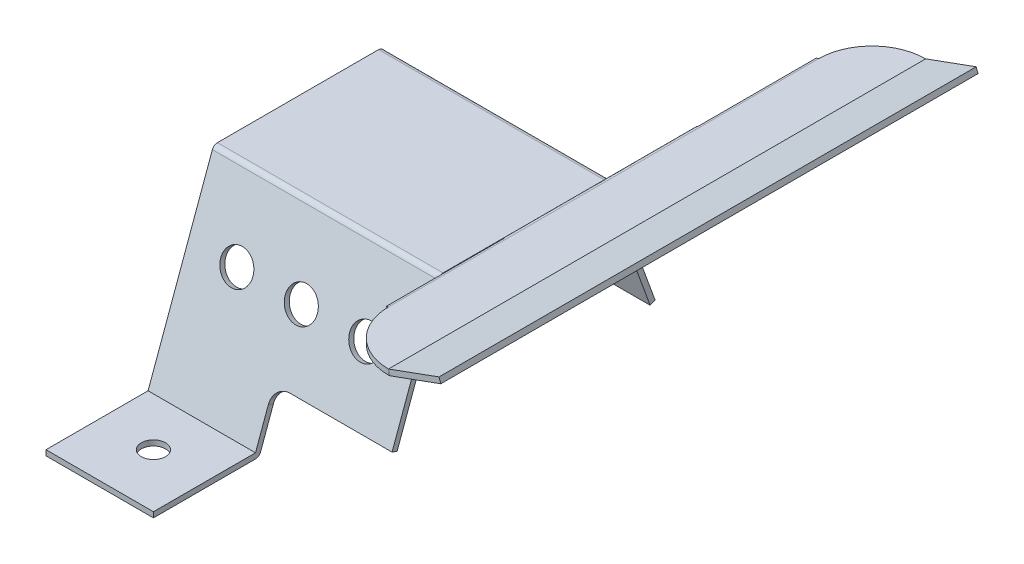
ISO-10303-21;
HEADER;
FILE_DESCRIPTION(('STEP AP214'),'2;1');
FILE_NAME('part.step','',(''),(''),'','','');
FILE_SCHEMA(('AUTOMOTIVE_DESIGN { 1 0 10303 214 1 1 1 1 }'));
ENDSEC;
DATA;
#1=APPLICATION_CONTEXT('core data for automotive mechanical design processes');
#2=APPLICATION_PROTOCOL_DEFINITION('international standard','automotive_design',2000,#1);
#3=PRODUCT_CONTEXT('',#1,'mechanical');
#4=PRODUCT('Part','Part','',(#3));
#5=PRODUCT_RELATED_PRODUCT_CATEGORY('part','',(#4));
#6=PRODUCT_DEFINITION_FORMATION('','',#4);
#7=PRODUCT_DEFINITION_CONTEXT('part definition',#1,'design');
#8=PRODUCT_DEFINITION('design','',#6,#7);
#9=PRODUCT_DEFINITION_SHAPE('','',#8);
#10=(LENGTH_UNIT() NAMED_UNIT(*) SI_UNIT(.MILLI.,.METRE.));
#11=(NAMED_UNIT(*) PLANE_ANGLE_UNIT() SI_UNIT($,.RADIAN.));
#12=(NAMED_UNIT(*) SI_UNIT($,.STERADIAN.) SOLID_ANGLE_UNIT());
#13=UNCERTAINTY_MEASURE_WITH_UNIT(LENGTH_MEASURE(1.E-05),#10,'distance_accuracy_value','');
#14=(GEOMETRIC_REPRESENTATION_CONTEXT(3) GLOBAL_UNCERTAINTY_ASSIGNED_CONTEXT((#13)) GLOBAL_UNIT_ASSIGNED_CONTEXT((#10,
#11,#12)) REPRESENTATION_CONTEXT('',''));
#15=CARTESIAN_POINT('',(0.,0.,0.));
#16=DIRECTION('',(0.,0.,1.));
#17=DIRECTION('',(1.,0.,0.));
#18=AXIS2_PLACEMENT_3D('',#15,#16,#17);
#19=CARTESIAN_POINT('',(42.,0.,-15.));
#20=DIRECTION('',(0.,-0.342020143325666,0.939692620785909));
#21=DIRECTION('',(0.,-0.93969262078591,-0.342020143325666));
#22=AXIS2_PLACEMENT_3D('',#19,#20,#21);
#23=PLANE('',#22);
#24=CARTESIAN_POINT('',(33.,-12.2160040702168,-19.4462618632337));
#25=DIRECTION('',(0.,-0.342020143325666,0.939692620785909));
#26=DIRECTION('',(0.,-0.93969262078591,-0.342020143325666));
#27=AXIS2_PLACEMENT_3D('',#24,#25,#26);
#28=CIRCLE('',#27,3.);
#29=CARTESIAN_POINT('',(33.,-15.0350819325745,-20.4723222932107));
#30=VERTEX_POINT('',#29);
#31=EDGE_CURVE('E514',#30,#30,#28,.F.);
#32=ORIENTED_EDGE('',*,*,#31,.T.);
#33=EDGE_LOOP('',(#32));
#34=FACE_BOUND('',#33,.T.);
#35=CARTESIAN_POINT('',(9.,-12.2160040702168,-19.4462618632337));
#36=DIRECTION('',(0.,-0.342020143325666,0.939692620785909));
#37=DIRECTION('',(0.,-0.93969262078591,-0.342020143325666));
#38=AXIS2_PLACEMENT_3D('',#35,#36,#37);
#39=CIRCLE('',#38,3.);
#40=CARTESIAN_POINT('',(9.,-15.0350819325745,-20.4723222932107));
#41=VERTEX_POINT('',#40);
#42=EDGE_CURVE('E526',#41,#41,#39,.F.);
#43=ORIENTED_EDGE('',*,*,#42,.T.);
#44=EDGE_LOOP('',(#43));
#45=FACE_BOUND('',#44,.T.);
#46=CARTESIAN_POINT('',(21.,-12.2160040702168,-19.4462618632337));
#47=DIRECTION('',(0.,-0.342020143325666,0.939692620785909));
#48=DIRECTION('',(0.,-0.93969262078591,-0.342020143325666));
#49=AXIS2_PLACEMENT_3D('',#46,#47,#48);
#50=CIRCLE('',#49,3.);
#51=CARTESIAN_POINT('',(21.,-15.0350819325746,-20.4723222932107));
#52=VERTEX_POINT('',#51);
#53=EDGE_CURVE('E520',#52,#52,#50,.F.);
#54=ORIENTED_EDGE('',*,*,#53,.T.);
#55=EDGE_LOOP('',(#54));
#56=FACE_BOUND('',#55,.T.);
#57=CARTESIAN_POINT('',(23.,-26.3113933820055,-24.5765640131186));
#58=DIRECTION('',(0.,-0.342020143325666,0.939692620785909));
#59=DIRECTION('',(0.,-0.93969262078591,-0.342020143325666));
#60=AXIS2_PLACEMENT_3D('',#57,#58,#59);
#61=CIRCLE('',#60,3.);
#62=CARTESIAN_POINT('',(20.,-26.3113933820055,-24.5765640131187));
#63=VERTEX_POINT('',#62);
#64=CARTESIAN_POINT('',(23.,-23.4923155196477,-23.5505035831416));
#65=VERTEX_POINT('',#64);
#66=EDGE_CURVE('E508',#63,#65,#61,.F.);
#67=ORIENTED_EDGE('',*,*,#66,.T.);
#68=DIRECTION('',(1.,0.,0.));
#69=VECTOR('',#68,1.);
#70=CARTESIAN_POINT('',(42.,-23.4923155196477,-23.5505035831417));
#71=LINE('',#70,#69);
#72=CARTESIAN_POINT('',(42.,-23.4923155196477,-23.5505035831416));
#73=VERTEX_POINT('',#72);
#74=EDGE_CURVE('E501',#65,#73,#71,.T.);
#75=ORIENTED_EDGE('',*,*,#74,.T.);
#76=DIRECTION('',(0.,0.939692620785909,0.342020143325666));
#77=VECTOR('',#76,1.);
#78=CARTESIAN_POINT('',(42.,0.,-15.));
#79=LINE('',#78,#77);
#80=CARTESIAN_POINT('',(42.,0.,-15.));
#81=VERTEX_POINT('',#80);
#82=EDGE_CURVE('E558',#73,#81,#79,.T.);
#83=ORIENTED_EDGE('',*,*,#82,.T.);
#84=DIRECTION('',(-1.,0.,0.));
#85=VECTOR('',#84,1.);
#86=CARTESIAN_POINT('',(42.,0.,-15.));
#87=LINE('',#86,#85);
#88=CARTESIAN_POINT('',(41.9996033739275,0.,-15.));
#89=VERTEX_POINT('',#88);
#90=EDGE_CURVE('E571',#81,#89,#87,.T.);
#91=ORIENTED_EDGE('',*,*,#90,.T.);
#92=DIRECTION('',(-1.,0.,0.));
#93=VECTOR('',#92,1.);
#94=CARTESIAN_POINT('',(0.,0.,-15.));
#95=LINE('',#94,#93);
#96=CARTESIAN_POINT('',(0.,0.,-15.));
#97=VERTEX_POINT('',#96);
#98=EDGE_CURVE('E1336',#89,#97,#95,.T.);
#99=ORIENTED_EDGE('',*,*,#98,.T.);
#100=DIRECTION('',(0.,0.939692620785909,0.342020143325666));
#101=VECTOR('',#100,1.);
#102=CARTESIAN_POINT('',(0.,0.,-15.));
#103=LINE('',#102,#101);
#104=CARTESIAN_POINT('',(0.,-32.8892417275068,-26.9707050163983));
#105=VERTEX_POINT('',#104);
#106=EDGE_CURVE('E568',#105,#97,#103,.T.);
#107=ORIENTED_EDGE('',*,*,#106,.F.);
#108=DIRECTION('',(-1.,0.,0.));
#109=VECTOR('',#108,1.);
#110=CARTESIAN_POINT('',(42.,-32.8892417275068,-26.9707050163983));
#111=LINE('',#110,#109);
#112=CARTESIAN_POINT('',(20.,-32.8892417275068,-26.9707050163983));
#113=VERTEX_POINT('',#112);
#114=EDGE_CURVE('E574',#113,#105,#111,.T.);
#115=ORIENTED_EDGE('',*,*,#114,.F.);
#116=DIRECTION('',(0.,0.939692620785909,0.342020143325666));
#117=VECTOR('',#116,1.);
#118=CARTESIAN_POINT('',(20.,0.,-15.));
#119=LINE('',#118,#117);
#120=EDGE_CURVE('E505',#113,#63,#119,.T.);
#121=ORIENTED_EDGE('',*,*,#120,.T.);
#122=EDGE_LOOP('',(#67,#75,#83,#91,#99,#107,#115,#121));
#123=FACE_BOUND('',#122,.T.);
#124=ADVANCED_FACE('F95',(#34,#45,#56,#123),#23,.T.);
#125=CARTESIAN_POINT('',(42.,0.342020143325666,-15.9396926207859));
#126=DIRECTION('',(0.,0.342020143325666,-0.939692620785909));
#127=DIRECTION('',(0.,0.939692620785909,0.342020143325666));
#128=AXIS2_PLACEMENT_3D('',#125,#126,#127);
#129=PLANE('',#128);
#130=CARTESIAN_POINT('',(33.,-11.8739839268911,-20.3859544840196));
#131=DIRECTION('',(0.,-0.342020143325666,0.93969262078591));
#132=DIRECTION('',(0.,-0.939692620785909,-0.342020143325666));
#133=AXIS2_PLACEMENT_3D('',#130,#131,#132);
#134=CIRCLE('',#133,3.);
#135=CARTESIAN_POINT('',(33.,-14.6930617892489,-21.4120149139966));
#136=VERTEX_POINT('',#135);
#137=EDGE_CURVE('E511',#136,#136,#134,.T.);
#138=ORIENTED_EDGE('',*,*,#137,.T.);
#139=EDGE_LOOP('',(#138));
#140=FACE_BOUND('',#139,.T.);
#141=CARTESIAN_POINT('',(9.,-11.8739839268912,-20.3859544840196));
#142=DIRECTION('',(0.,-0.342020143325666,0.93969262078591));
#143=DIRECTION('',(0.,-0.939692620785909,-0.342020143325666));
#144=AXIS2_PLACEMENT_3D('',#141,#142,#143);
#145=CIRCLE('',#144,3.);
#146=CARTESIAN_POINT('',(9.,-14.6930617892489,-21.4120149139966));
#147=VERTEX_POINT('',#146);
#148=EDGE_CURVE('E523',#147,#147,#145,.T.);
#149=ORIENTED_EDGE('',*,*,#148,.T.);
#150=EDGE_LOOP('',(#149));
#151=FACE_BOUND('',#150,.T.);
#152=CARTESIAN_POINT('',(21.,-11.8739839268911,-20.3859544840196));
#153=DIRECTION('',(0.,-0.342020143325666,0.93969262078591));
#154=DIRECTION('',(0.,-0.939692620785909,-0.342020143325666));
#155=AXIS2_PLACEMENT_3D('',#152,#153,#154);
#156=CIRCLE('',#155,3.);
#157=CARTESIAN_POINT('',(21.,-14.6930617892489,-21.4120149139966));
#158=VERTEX_POINT('',#157);
#159=EDGE_CURVE('E517',#158,#158,#156,.T.);
#160=ORIENTED_EDGE('',*,*,#159,.T.);
#161=EDGE_LOOP('',(#160));
#162=FACE_BOUND('',#161,.T.);
#163=DIRECTION('',(0.,-0.939692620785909,-0.342020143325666));
#164=VECTOR('',#163,1.);
#165=CARTESIAN_POINT('',(42.,0.342020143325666,-15.9396926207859));
#166=LINE('',#165,#164);
#167=CARTESIAN_POINT('',(42.,0.342020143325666,-15.9396926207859));
#168=VERTEX_POINT('',#167);
#169=CARTESIAN_POINT('',(42.,-23.1502953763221,-24.4901962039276));
#170=VERTEX_POINT('',#169);
#171=EDGE_CURVE('E555',#168,#170,#166,.T.);
#172=ORIENTED_EDGE('',*,*,#171,.T.);
#173=DIRECTION('',(-1.,0.,0.));
#174=VECTOR('',#173,1.);
#175=CARTESIAN_POINT('',(42.,-23.1502953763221,-24.4901962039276));
#176=LINE('',#175,#174);
#177=CARTESIAN_POINT('',(23.,-23.1502953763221,-24.4901962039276));
#178=VERTEX_POINT('',#177);
#179=EDGE_CURVE('E112',#170,#178,#176,.T.);
#180=ORIENTED_EDGE('',*,*,#179,.T.);
#181=CARTESIAN_POINT('',(23.,-25.9693732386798,-25.5162566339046));
#182=DIRECTION('',(0.,-0.342020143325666,0.93969262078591));
#183=DIRECTION('',(0.,0.939692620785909,0.342020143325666));
#184=AXIS2_PLACEMENT_3D('',#181,#182,#183);
#185=CIRCLE('',#184,3.);
#186=CARTESIAN_POINT('',(20.,-25.9693732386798,-25.5162566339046));
#187=VERTEX_POINT('',#186);
#188=EDGE_CURVE('E494',#178,#187,#185,.T.);
#189=ORIENTED_EDGE('',*,*,#188,.T.);
#190=DIRECTION('',(0.,-0.939692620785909,-0.342020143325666));
#191=VECTOR('',#190,1.);
#192=CARTESIAN_POINT('',(20.,-32.5472215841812,-27.9103976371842));
#193=LINE('',#192,#191);
#194=CARTESIAN_POINT('',(20.,-32.5472215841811,-27.9103976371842));
#195=VERTEX_POINT('',#194);
#196=EDGE_CURVE('E488',#187,#195,#193,.T.);
#197=ORIENTED_EDGE('',*,*,#196,.T.);
#198=DIRECTION('',(-1.,0.,0.));
#199=VECTOR('',#198,1.);
#200=CARTESIAN_POINT('',(42.,-32.5472215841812,-27.9103976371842));
#201=LINE('',#200,#199);
#202=CARTESIAN_POINT('',(0.,-32.5472215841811,-27.9103976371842));
#203=VERTEX_POINT('',#202);
#204=EDGE_CURVE('E577',#195,#203,#201,.T.);
#205=ORIENTED_EDGE('',*,*,#204,.T.);
#206=DIRECTION('',(0.,-0.939692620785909,-0.342020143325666));
#207=VECTOR('',#206,1.);
#208=CARTESIAN_POINT('',(0.,0.342020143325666,-15.9396926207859));
#209=LINE('',#208,#207);
#210=CARTESIAN_POINT('',(0.,0.342020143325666,-15.9396926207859));
#211=VERTEX_POINT('',#210);
#212=EDGE_CURVE('E565',#211,#203,#209,.T.);
#213=ORIENTED_EDGE('',*,*,#212,.F.);
#214=DIRECTION('',(-1.,0.,0.));
#215=VECTOR('',#214,1.);
#216=CARTESIAN_POINT('',(42.,0.342020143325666,-15.9396926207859));
#217=LINE('',#216,#215);
#218=EDGE_CURVE('E580',#168,#211,#217,.T.);
#219=ORIENTED_EDGE('',*,*,#218,.F.);
#220=EDGE_LOOP('',(#172,#180,#189,#197,#205,#213,#219));
#221=FACE_BOUND('',#220,.T.);
#222=ADVANCED_FACE('F1479',(#140,#151,#162,#221),#129,.T.);
#223=CARTESIAN_POINT('',(42.,0.,-15.));
#224=DIRECTION('',(1.,0.,0.));
#225=DIRECTION('',(0.,0.,-1.));
#226=AXIS2_PLACEMENT_3D('',#223,#224,#225);
#227=PLANE('',#226);
#228=ORIENTED_EDGE('',*,*,#82,.F.);
#229=DIRECTION('',(0.,0.342020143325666,-0.939692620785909));
#230=VECTOR('',#229,1.);
#231=CARTESIAN_POINT('',(42.,-23.4923155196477,-23.5505035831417));
#232=LINE('',#231,#230);
#233=EDGE_CURVE('E12',#73,#170,#232,.T.);
#234=ORIENTED_EDGE('',*,*,#233,.T.);
#235=ORIENTED_EDGE('',*,*,#171,.F.);
#236=CARTESIAN_POINT('',(42.,0.,-15.));
#237=DIRECTION('',(-1.,0.,0.));
#238=DIRECTION('',(0.,0.,-1.));
#239=AXIS2_PLACEMENT_3D('',#236,#237,#238);
#240=CIRCLE('',#239,0.999999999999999);
#241=CARTESIAN_POINT('',(41.999971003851,1.00009446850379,-15.));
#242=VERTEX_POINT('',#241);
#243=EDGE_CURVE('E559',#242,#168,#240,.T.);
#244=ORIENTED_EDGE('',*,*,#243,.F.);
#245=DIRECTION('',(0.,1.,0.));
#246=VECTOR('',#245,1.);
#247=CARTESIAN_POINT('',(42.,0.,-15.));
#248=LINE('',#247,#246);
#249=EDGE_CURVE('E561',#81,#242,#248,.T.);
#250=ORIENTED_EDGE('',*,*,#249,.F.);
#251=EDGE_LOOP('',(#228,#234,#235,#244,#250));
#252=FACE_BOUND('',#251,.T.);
#253=ADVANCED_FACE('F1485',(#252),#227,.T.);
#254=CARTESIAN_POINT('',(41.9996033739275,1.001,15.));
#255=DIRECTION('',(0.,0.,-1.));
#256=DIRECTION('',(-1.,0.,0.));
#257=AXIS2_PLACEMENT_3D('',#254,#255,#256);
#258=PLANE('',#257);
#259=DIRECTION('',(0.707106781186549,-0.707106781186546,0.));
#260=VECTOR('',#259,1.);
#261=CARTESIAN_POINT('',(42.0003104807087,1.00029289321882,15.));
#262=LINE('',#261,#260);
#263=CARTESIAN_POINT('',(41.9998093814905,0.999999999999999,15.));
#264=VERTEX_POINT('',#263);
#265=CARTESIAN_POINT('',(42.7074172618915,0.293186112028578,15.));
#266=VERTEX_POINT('',#265);
#267=EDGE_CURVE('E909',#264,#266,#262,.T.);
#268=ORIENTED_EDGE('',*,*,#267,.F.);
#269=DIRECTION('',(0.,-1.,0.));
#270=VECTOR('',#269,1.);
#271=CARTESIAN_POINT('',(42.,0.,15.));
#272=LINE('',#271,#270);
#273=CARTESIAN_POINT('',(42.,0.,15.));
#274=VERTEX_POINT('',#273);
#275=EDGE_CURVE('E594',#264,#274,#272,.T.);
#276=ORIENTED_EDGE('',*,*,#275,.T.);
#277=CARTESIAN_POINT('',(41.9996033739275,1.001,15.));
#278=DIRECTION('',(0.,0.,-1.));
#279=DIRECTION('',(-1.,0.,0.));
#280=AXIS2_PLACEMENT_3D('',#277,#278,#279);
#281=CIRCLE('',#280,1.001);
#282=EDGE_CURVE('E906',#274,#266,#281,.F.);
#283=ORIENTED_EDGE('',*,*,#282,.T.);
#284=EDGE_LOOP('',(#268,#276,#283));
#285=FACE_BOUND('',#284,.T.);
#286=ADVANCED_FACE('F905',(#285),#258,.F.);
#287=CARTESIAN_POINT('',(66.8492693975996,15.4350400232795,40.));
#288=DIRECTION('',(0.,-1.,0.));
#289=DIRECTION('',(0.,0.,-1.));
#290=AXIS2_PLACEMENT_3D('',#287,#288,#289);
#291=CYLINDRICAL_SURFACE('',#290,10.);
#292=CARTESIAN_POINT('',(66.8492693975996,15.4350400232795,40.));
#293=DIRECTION('',(0.,1.,0.));
#294=DIRECTION('',(0.,0.,1.));
#295=AXIS2_PLACEMENT_3D('',#292,#293,#294);
#296=CIRCLE('',#295,10.);
#297=CARTESIAN_POINT('',(56.8493125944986,15.4350400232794,40.0293927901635));
#298=VERTEX_POINT('',#297);
#299=CARTESIAN_POINT('',(66.8490931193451,15.4350400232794,49.9999999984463));
#300=VERTEX_POINT('',#299);
#301=EDGE_CURVE('E1188',#298,#300,#296,.T.);
#302=ORIENTED_EDGE('',*,*,#301,.F.);
#303=CARTESIAN_POINT('',(56.8493125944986,14.4350400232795,40.0293927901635));
#304=CARTESIAN_POINT('',(56.8493125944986,15.4350400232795,40.0293927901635));
#305=B_SPLINE_CURVE_WITH_KNOTS('',1,(#303,#304),.UNSPECIFIED.,.F.,.F.,(2,2),(0.,1.),.UNSPECIFIED.);
#306=CARTESIAN_POINT('',(56.8493125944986,14.4350400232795,40.0293927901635));
#307=VERTEX_POINT('',#306);
#308=EDGE_CURVE('E862',#298,#307,#305,.F.);
#309=ORIENTED_EDGE('',*,*,#308,.T.);
#310=CARTESIAN_POINT('',(66.8492693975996,14.4350400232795,40.));
#311=DIRECTION('',(0.,1.,0.));
#312=DIRECTION('',(0.,0.,1.));
#313=AXIS2_PLACEMENT_3D('',#310,#311,#312);
#314=CIRCLE('',#313,10.);
#315=CARTESIAN_POINT('',(66.8490931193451,14.4350400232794,49.9999999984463));
#316=VERTEX_POINT('',#315);
#317=EDGE_CURVE('E1110',#307,#316,#314,.T.);
#318=ORIENTED_EDGE('',*,*,#317,.T.);
#319=DIRECTION('',(0.,-1.,0.));
#320=VECTOR('',#319,1.);
#321=CARTESIAN_POINT('',(66.8490931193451,15.4350400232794,49.9999999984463));
#322=LINE('',#321,#320);
#323=EDGE_CURVE('E1115',#300,#316,#322,.T.);
#324=ORIENTED_EDGE('',*,*,#323,.F.);
#325=EDGE_LOOP('',(#302,#309,#318,#324));
#326=FACE_BOUND('',#325,.T.);
#327=ADVANCED_FACE('F97',(#326),#291,.T.);
#328=CARTESIAN_POINT('',(66.8492693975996,15.4350400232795,-40.));
#329=DIRECTION('',(0.,-1.,0.));
#330=DIRECTION('',(0.,0.,-1.));
#331=AXIS2_PLACEMENT_3D('',#328,#329,#330);
#332=CYLINDRICAL_SURFACE('',#331,10.);
#333=CARTESIAN_POINT('',(66.8492693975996,14.4350400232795,-40.));
#334=DIRECTION('',(0.,1.,0.));
#335=DIRECTION('',(0.,0.,-1.));
#336=AXIS2_PLACEMENT_3D('',#333,#334,#335);
#337=CIRCLE('',#336,10.);
#338=CARTESIAN_POINT('',(66.8490931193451,14.4350400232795,-49.9999999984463));
#339=VERTEX_POINT('',#338);
#340=CARTESIAN_POINT('',(56.8493125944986,14.4350400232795,-40.0293927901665));
#341=VERTEX_POINT('',#340);
#342=EDGE_CURVE('E826',#339,#341,#337,.T.);
#343=ORIENTED_EDGE('',*,*,#342,.T.);
#344=CARTESIAN_POINT('',(56.8493125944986,15.4350400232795,-40.0293927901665));
#345=CARTESIAN_POINT('',(56.8493125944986,14.4350400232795,-40.0293927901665));
#346=B_SPLINE_CURVE_WITH_KNOTS('',1,(#344,#345),.UNSPECIFIED.,.F.,.F.,(2,2),(0.,1.),.UNSPECIFIED.);
#347=CARTESIAN_POINT('',(56.8493125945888,15.4350400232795,-40.0293927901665));
#348=VERTEX_POINT('',#347);
#349=EDGE_CURVE('E1202',#341,#348,#346,.F.);
#350=ORIENTED_EDGE('',*,*,#349,.T.);
#351=CARTESIAN_POINT('',(66.8492693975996,15.4350400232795,-40.));
#352=DIRECTION('',(0.,1.,0.));
#353=DIRECTION('',(0.,0.,-1.));
#354=AXIS2_PLACEMENT_3D('',#351,#352,#353);
#355=CIRCLE('',#354,10.);
#356=CARTESIAN_POINT('',(66.8490931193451,15.4350400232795,-49.9999999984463));
#357=VERTEX_POINT('',#356);
#358=EDGE_CURVE('E1114',#357,#348,#355,.T.);
#359=ORIENTED_EDGE('',*,*,#358,.F.);
#360=DIRECTION('',(0.,1.,0.));
#361=VECTOR('',#360,1.);
#362=CARTESIAN_POINT('',(66.8490931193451,15.4350400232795,-49.9999999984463));
#363=LINE('',#362,#361);
#364=EDGE_CURVE('E1111',#339,#357,#363,.T.);
#365=ORIENTED_EDGE('',*,*,#364,.F.);
#366=EDGE_LOOP('',(#343,#350,#359,#365));
#367=FACE_BOUND('',#366,.T.);
#368=ADVANCED_FACE('F842',(#367),#332,.T.);
#369=CARTESIAN_POINT('',(66.8492693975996,15.4350400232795,-40.));
#370=DIRECTION('',(0.,-1.,0.));
#371=DIRECTION('',(0.,0.,-1.));
#372=AXIS2_PLACEMENT_3D('',#369,#370,#371);
#373=PLANE('',#372);
#374=ORIENTED_EDGE('',*,*,#358,.T.);
#375=DIRECTION('',(0.,0.,1.));
#376=VECTOR('',#375,1.);
#377=CARTESIAN_POINT('',(56.8493125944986,15.4350400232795,-40.));
#378=LINE('',#377,#376);
#379=EDGE_CURVE('E1145',#348,#298,#378,.T.);
#380=ORIENTED_EDGE('',*,*,#379,.T.);
#381=ORIENTED_EDGE('',*,*,#301,.T.);
#382=DIRECTION('',(0.,0.,1.));
#383=VECTOR('',#382,1.);
#384=CARTESIAN_POINT('',(66.8490931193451,15.4350400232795,-40.));
#385=LINE('',#384,#383);
#386=EDGE_CURVE('E1106',#357,#300,#385,.T.);
#387=ORIENTED_EDGE('',*,*,#386,.F.);
#388=EDGE_LOOP('',(#374,#380,#381,#387));
#389=FACE_BOUND('',#388,.T.);
#390=ADVANCED_FACE('F840',(#389),#373,.F.);
#391=CARTESIAN_POINT('',(66.8492694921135,15.4350400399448,-50.));
#392=DIRECTION('',(0.,0.,1.));
#393=DIRECTION('',(0.939692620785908,0.342020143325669,0.));
#394=AXIS2_PLACEMENT_3D('',#391,#392,#393);
#395=PLANE('',#394);
#396=DIRECTION('',(-0.939692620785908,-0.342020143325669,0.));
#397=VECTOR('',#396,1.);
#398=CARTESIAN_POINT('',(67.1912896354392,14.4953474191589,-50.));
#399=LINE('',#398,#397);
#400=CARTESIAN_POINT('',(76.5882158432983,17.9155488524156,-50.));
#401=VERTEX_POINT('',#400);
#402=CARTESIAN_POINT('',(67.1914552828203,14.495407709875,-50.));
#403=VERTEX_POINT('',#402);
#404=EDGE_CURVE('E1126',#401,#403,#399,.T.);
#405=ORIENTED_EDGE('',*,*,#404,.T.);
#406=DIRECTION('',(-0.342020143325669,0.939692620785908,0.));
#407=VECTOR('',#406,1.);
#408=CARTESIAN_POINT('',(66.8494351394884,15.4351003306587,-50.));
#409=LINE('',#408,#407);
#410=CARTESIAN_POINT('',(66.8494351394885,15.4351003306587,-50.));
#411=VERTEX_POINT('',#410);
#412=EDGE_CURVE('E1137',#403,#411,#409,.T.);
#413=ORIENTED_EDGE('',*,*,#412,.T.);
#414=DIRECTION('',(-0.939692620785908,-0.342020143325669,0.));
#415=VECTOR('',#414,1.);
#416=CARTESIAN_POINT('',(66.8492694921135,15.4350400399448,-50.));
#417=LINE('',#416,#415);
#418=CARTESIAN_POINT('',(76.2461956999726,18.8552414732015,-50.));
#419=VERTEX_POINT('',#418);
#420=EDGE_CURVE('E1122',#419,#411,#417,.T.);
#421=ORIENTED_EDGE('',*,*,#420,.F.);
#422=DIRECTION('',(0.342020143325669,-0.939692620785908,0.));
#423=VECTOR('',#422,1.);
#424=CARTESIAN_POINT('',(76.2461956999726,18.8552414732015,-50.));
#425=LINE('',#424,#423);
#426=EDGE_CURVE('E1128',#419,#401,#425,.T.);
#427=ORIENTED_EDGE('',*,*,#426,.T.);
#428=EDGE_LOOP('',(#405,#413,#421,#427));
#429=FACE_BOUND('',#428,.T.);
#430=ADVANCED_FACE('F1164',(#429),#395,.F.);
#431=CARTESIAN_POINT('',(66.8492694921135,15.4350400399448,50.));
#432=DIRECTION('',(0.,0.,-1.));
#433=DIRECTION('',(-0.939692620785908,-0.342020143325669,0.));
#434=AXIS2_PLACEMENT_3D('',#431,#432,#433);
#435=PLANE('',#434);
#436=DIRECTION('',(0.939692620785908,0.342020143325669,0.));
#437=VECTOR('',#436,1.);
#438=CARTESIAN_POINT('',(66.8492694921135,15.4350400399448,50.));
#439=LINE('',#438,#437);
#440=CARTESIAN_POINT('',(66.8494351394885,15.4351003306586,50.));
#441=VERTEX_POINT('',#440);
#442=CARTESIAN_POINT('',(76.2461956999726,18.8552414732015,50.));
#443=VERTEX_POINT('',#442);
#444=EDGE_CURVE('E1123',#441,#443,#439,.T.);
#445=ORIENTED_EDGE('',*,*,#444,.F.);
#446=DIRECTION('',(0.342020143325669,-0.939692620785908,0.));
#447=VECTOR('',#446,1.);
#448=CARTESIAN_POINT('',(66.8494351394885,15.4351003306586,50.));
#449=LINE('',#448,#447);
#450=CARTESIAN_POINT('',(67.1914552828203,14.495407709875,50.));
#451=VERTEX_POINT('',#450);
#452=EDGE_CURVE('E1142',#441,#451,#449,.T.);
#453=ORIENTED_EDGE('',*,*,#452,.T.);
#454=DIRECTION('',(0.939692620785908,0.342020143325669,0.));
#455=VECTOR('',#454,1.);
#456=CARTESIAN_POINT('',(67.1912896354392,14.4953474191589,50.));
#457=LINE('',#456,#455);
#458=CARTESIAN_POINT('',(76.5882158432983,17.9155488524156,50.));
#459=VERTEX_POINT('',#458);
#460=EDGE_CURVE('E1127',#451,#459,#457,.T.);
#461=ORIENTED_EDGE('',*,*,#460,.T.);
#462=DIRECTION('',(0.342020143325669,-0.939692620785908,0.));
#463=VECTOR('',#462,1.);
#464=CARTESIAN_POINT('',(76.2461956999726,18.8552414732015,50.));
#465=LINE('',#464,#463);
#466=EDGE_CURVE('E1131',#443,#459,#465,.T.);
#467=ORIENTED_EDGE('',*,*,#466,.F.);
#468=EDGE_LOOP('',(#445,#453,#461,#467));
#469=FACE_BOUND('',#468,.T.);
#470=ADVANCED_FACE('F1157',(#469),#435,.F.);
#471=CARTESIAN_POINT('',(66.8492694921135,15.4350400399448,-40.));
#472=DIRECTION('',(0.342020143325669,-0.939692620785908,0.));
#473=DIRECTION('',(0.,0.,-1.));
#474=AXIS2_PLACEMENT_3D('',#471,#472,#473);
#475=PLANE('',#474);
#476=ORIENTED_EDGE('',*,*,#420,.T.);
#477=DIRECTION('',(0.,0.,1.));
#478=VECTOR('',#477,1.);
#479=CARTESIAN_POINT('',(66.8494351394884,15.4351003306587,-40.));
#480=LINE('',#479,#478);
#481=EDGE_CURVE('E1134',#411,#441,#480,.T.);
#482=ORIENTED_EDGE('',*,*,#481,.T.);
#483=ORIENTED_EDGE('',*,*,#444,.T.);
#484=DIRECTION('',(0.,0.,-1.));
#485=VECTOR('',#484,1.);
#486=CARTESIAN_POINT('',(76.2461956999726,18.8552414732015,-50.));
#487=LINE('',#486,#485);
#488=EDGE_CURVE('E1120',#443,#419,#487,.T.);
#489=ORIENTED_EDGE('',*,*,#488,.T.);
#490=EDGE_LOOP('',(#476,#482,#483,#489));
#491=FACE_BOUND('',#490,.T.);
#492=ADVANCED_FACE('F1153',(#491),#475,.F.);
#493=CARTESIAN_POINT('',(67.1912896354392,14.4953474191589,-40.));
#494=DIRECTION('',(0.342020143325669,-0.939692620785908,0.));
#495=DIRECTION('',(0.,0.,-1.));
#496=AXIS2_PLACEMENT_3D('',#493,#494,#495);
#497=PLANE('',#496);
#498=DIRECTION('',(0.,0.,1.));
#499=VECTOR('',#498,1.);
#500=CARTESIAN_POINT('',(67.1914552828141,14.4954077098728,-40.));
#501=LINE('',#500,#499);
#502=EDGE_CURVE('E1140',#403,#451,#501,.T.);
#503=ORIENTED_EDGE('',*,*,#502,.F.);
#504=ORIENTED_EDGE('',*,*,#404,.F.);
#505=DIRECTION('',(0.,0.,-1.));
#506=VECTOR('',#505,1.);
#507=CARTESIAN_POINT('',(76.5882158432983,17.9155488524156,-50.));
#508=LINE('',#507,#506);
#509=EDGE_CURVE('E1124',#459,#401,#508,.T.);
#510=ORIENTED_EDGE('',*,*,#509,.F.);
#511=ORIENTED_EDGE('',*,*,#460,.F.);
#512=EDGE_LOOP('',(#503,#504,#510,#511));
#513=FACE_BOUND('',#512,.T.);
#514=ADVANCED_FACE('F2027',(#513),#497,.T.);
#515=CARTESIAN_POINT('',(76.2461956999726,18.8552414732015,-50.));
#516=DIRECTION('',(-0.939692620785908,-0.342020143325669,0.));
#517=DIRECTION('',(0.,0.,1.));
#518=AXIS2_PLACEMENT_3D('',#515,#516,#517);
#519=PLANE('',#518);
#520=ORIENTED_EDGE('',*,*,#509,.T.);
#521=ORIENTED_EDGE('',*,*,#426,.F.);
#522=ORIENTED_EDGE('',*,*,#488,.F.);
#523=ORIENTED_EDGE('',*,*,#466,.T.);
#524=EDGE_LOOP('',(#520,#521,#522,#523));
#525=FACE_BOUND('',#524,.T.);
#526=ADVANCED_FACE('F839',(#525),#519,.F.);
#527=CARTESIAN_POINT('',(66.8492693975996,14.4350400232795,-40.));
#528=DIRECTION('',(0.,-1.,0.));
#529=DIRECTION('',(0.,0.,-1.));
#530=AXIS2_PLACEMENT_3D('',#527,#528,#529);
#531=PLANE('',#530);
#532=CARTESIAN_POINT('',(56.8493125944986,14.4350400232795,-40.0293927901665));
#533=CARTESIAN_POINT('',(56.8492995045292,14.4350400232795,-40.0195951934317));
#534=CARTESIAN_POINT('',(56.8492864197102,14.4350374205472,-40.0097975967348));
#535=CARTESIAN_POINT('',(56.8492743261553,14.4350324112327,-40.));
#536=B_SPLINE_CURVE_WITH_KNOTS('',3,(#532,#533,#534,#535),.UNSPECIFIED.,.F.,.F.,(4,4),(0.,1.),.UNSPECIFIED.);
#537=CARTESIAN_POINT('',(56.849293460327,14.4350362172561,-40.));
#538=VERTEX_POINT('',#537);
#539=EDGE_CURVE('E1203',#341,#538,#536,.T.);
#540=ORIENTED_EDGE('',*,*,#539,.F.);
#541=ORIENTED_EDGE('',*,*,#342,.F.);
#542=DIRECTION('',(0.,0.,1.));
#543=VECTOR('',#542,1.);
#544=CARTESIAN_POINT('',(66.8490931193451,14.4350400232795,-40.));
#545=LINE('',#544,#543);
#546=EDGE_CURVE('E1107',#339,#316,#545,.T.);
#547=ORIENTED_EDGE('',*,*,#546,.T.);
#548=ORIENTED_EDGE('',*,*,#317,.F.);
#549=CARTESIAN_POINT('',(56.8492743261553,14.4350324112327,40.));
#550=CARTESIAN_POINT('',(56.8492864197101,14.4350374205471,40.0097975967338));
#551=CARTESIAN_POINT('',(56.8492995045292,14.4350400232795,40.0195951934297));
#552=CARTESIAN_POINT('',(56.8493125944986,14.4350400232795,40.0293927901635));
#553=B_SPLINE_CURVE_WITH_KNOTS('',3,(#549,#550,#551,#552),.UNSPECIFIED.,.F.,.F.,(4,4),(0.,1.),.UNSPECIFIED.);
#554=CARTESIAN_POINT('',(56.849293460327,14.4350362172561,40.));
#555=VERTEX_POINT('',#554);
#556=EDGE_CURVE('E814',#307,#555,#553,.F.);
#557=ORIENTED_EDGE('',*,*,#556,.T.);
#558=CARTESIAN_POINT('',(56.8492743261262,14.4350324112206,18.));
#559=DIRECTION('',(2.64939585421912E-12,1.09705489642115E-12,1.));
#560=VECTOR('',#559,1.);
#561=LINE('',#558,#560);
#562=CARTESIAN_POINT('',(56.849293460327,14.4350362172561,18.));
#563=VERTEX_POINT('',#562);
#564=EDGE_CURVE('E807',#563,#555,#561,.T.);
#565=ORIENTED_EDGE('',*,*,#564,.F.);
#566=CARTESIAN_POINT('',(56.8492418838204,14.4350107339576,17.9839009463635));
#567=CARTESIAN_POINT('',(56.8492511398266,14.4350199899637,17.9892672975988));
#568=CARTESIAN_POINT('',(56.8492622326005,14.4350274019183,17.9946336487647));
#569=CARTESIAN_POINT('',(56.8492743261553,14.4350324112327,18.));
#570=B_SPLINE_CURVE_WITH_KNOTS('',3,(#566,#567,#568,#569),.UNSPECIFIED.,.F.,.F.,(4,4),(0.,1.),.UNSPECIFIED.);
#571=CARTESIAN_POINT('',(56.8492772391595,14.4350253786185,17.9839009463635));
#572=VERTEX_POINT('',#571);
#573=EDGE_CURVE('E798',#563,#572,#570,.F.);
#574=ORIENTED_EDGE('',*,*,#573,.T.);
#575=CARTESIAN_POINT('',(56.8492418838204,14.4350107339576,0.0160990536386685));
#576=DIRECTION('',(0.,0.,1.));
#577=VECTOR('',#576,1.);
#578=LINE('',#575,#577);
#579=CARTESIAN_POINT('',(56.8492772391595,14.4350253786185,0.0160990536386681));
#580=VERTEX_POINT('',#579);
#581=EDGE_CURVE('E932',#580,#572,#578,.T.);
#582=ORIENTED_EDGE('',*,*,#581,.F.);
#583=CARTESIAN_POINT('',(56.8492418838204,14.4350107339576,-0.0160990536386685));
#584=CARTESIAN_POINT('',(56.8492469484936,14.4350157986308,-0.014090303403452));
#585=CARTESIAN_POINT('',(56.8492515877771,14.4350193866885,-0.0124151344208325));
#586=CARTESIAN_POINT('',(56.8492571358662,14.4350232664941,-0.0104027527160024));
#587=CARTESIAN_POINT('',(56.8492587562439,14.4350243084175,-0.00981535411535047));
#588=CARTESIAN_POINT('',(56.8492614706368,14.4350259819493,-0.00880734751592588));
#589=CARTESIAN_POINT('',(56.8492616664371,14.4350261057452,-0.00876013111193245));
#590=CARTESIAN_POINT('',(56.8492702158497,14.4350309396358,-0.0052071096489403));
#591=CARTESIAN_POINT('',(56.8492743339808,14.4350324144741,-0.00169761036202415));
#592=CARTESIAN_POINT('',(56.8492743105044,14.4350324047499,0.00339522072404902));
#593=CARTESIAN_POINT('',(56.8492603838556,14.4350292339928,0.00876157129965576));
#594=CARTESIAN_POINT('',(56.8492418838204,14.4350107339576,0.0160990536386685));
#595=B_SPLINE_CURVE_WITH_KNOTS('',3,(#583,#584,#585,#586,#587,#588,#589,#590,#591,#592,#593,
#594),.UNSPECIFIED.,.F.,.F.,(4,2,2,2,2,4),(0.,0.125,0.1875,0.25,0.5,1.),.UNSPECIFIED.);
#596=CARTESIAN_POINT('',(56.8492772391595,14.4350253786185,-0.016099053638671));
#597=VERTEX_POINT('',#596);
#598=EDGE_CURVE('E808',#580,#597,#595,.F.);
#599=ORIENTED_EDGE('',*,*,#598,.T.);
#600=CARTESIAN_POINT('',(56.8492418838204,14.4350107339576,-17.9839009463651));
#601=DIRECTION('',(0.,0.,1.));
#602=VECTOR('',#601,1.);
#603=LINE('',#600,#602);
#604=CARTESIAN_POINT('',(56.8492772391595,14.4350253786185,-17.9839009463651));
#605=VERTEX_POINT('',#604);
#606=EDGE_CURVE('E975',#605,#597,#603,.T.);
#607=ORIENTED_EDGE('',*,*,#606,.F.);
#608=CARTESIAN_POINT('',(56.8492743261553,14.4350324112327,-18.));
#609=CARTESIAN_POINT('',(56.8492622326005,14.4350274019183,-17.9946336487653));
#610=CARTESIAN_POINT('',(56.8492511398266,14.4350199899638,-17.9892672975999));
#611=CARTESIAN_POINT('',(56.8492418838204,14.4350107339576,-17.9839009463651));
#612=B_SPLINE_CURVE_WITH_KNOTS('',3,(#608,#609,#610,#611),.UNSPECIFIED.,.F.,.F.,(4,4),(0.,1.),.UNSPECIFIED.);
#613=CARTESIAN_POINT('',(56.849293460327,14.4350362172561,-18.));
#614=VERTEX_POINT('',#613);
#615=EDGE_CURVE('E1217',#605,#614,#612,.F.);
#616=ORIENTED_EDGE('',*,*,#615,.T.);
#617=CARTESIAN_POINT('',(56.8492743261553,14.4350324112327,-40.));
#618=DIRECTION('',(0.,0.,1.));
#619=VECTOR('',#618,1.);
#620=LINE('',#617,#619);
#621=EDGE_CURVE('E607',#538,#614,#620,.T.);
#622=ORIENTED_EDGE('',*,*,#621,.F.);
#623=EDGE_LOOP('',(#540,#541,#547,#548,#557,#565,#574,#582,#599,#607,#616,#622));
#624=FACE_BOUND('',#623,.T.);
#625=ADVANCED_FACE('F812',(#624),#531,.T.);
#626=CARTESIAN_POINT('',(66.8490931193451,15.4360400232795,-50.));
#627=DIRECTION('',(0.,0.,1.));
#628=DIRECTION('',(1.,0.,0.));
#629=AXIS2_PLACEMENT_3D('',#626,#627,#628);
#630=PLANE('',#629);
#631=DIRECTION('',(-0.173648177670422,0.984807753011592,0.));
#632=VECTOR('',#631,1.);
#633=CARTESIAN_POINT('',(66.8492667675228,15.4350552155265,-50.));
#634=LINE('',#633,#632);
#635=CARTESIAN_POINT('',(67.0229149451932,14.4502474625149,-50.));
#636=VERTEX_POINT('',#635);
#637=CARTESIAN_POINT('',(66.8492667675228,15.4350552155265,-50.));
#638=VERTEX_POINT('',#637);
#639=EDGE_CURVE('E1103',#636,#638,#634,.T.);
#640=ORIENTED_EDGE('',*,*,#639,.F.);
#641=CARTESIAN_POINT('',(67.0486604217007,14.4551353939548,-50.));
#642=CARTESIAN_POINT('',(67.0424780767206,14.4538775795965,-49.9999999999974));
#643=CARTESIAN_POINT('',(67.0362840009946,14.4526782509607,-49.9999999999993));
#644=CARTESIAN_POINT('',(67.0276926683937,14.4510988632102,-50.0000000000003));
#645=CARTESIAN_POINT('',(67.0253045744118,14.4506688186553,-50.0000000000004));
#646=CARTESIAN_POINT('',(67.0190915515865,14.4495732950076,-49.9999999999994));
#647=CARTESIAN_POINT('',(67.0152642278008,14.4489213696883,-49.9999999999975));
#648=CARTESIAN_POINT('',(67.0052078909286,14.4472685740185,-49.999999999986));
#649=CARTESIAN_POINT('',(66.9989728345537,14.4463042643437,-49.9999999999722));
#650=CARTESIAN_POINT('',(66.9864856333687,14.4444937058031,-49.9999999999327));
#651=CARTESIAN_POINT('',(66.9802334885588,14.4436474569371,-49.9999999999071));
#652=CARTESIAN_POINT('',(66.9677143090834,14.4420733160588,-49.9999999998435));
#653=CARTESIAN_POINT('',(66.961447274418,14.4413454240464,-49.9999999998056));
#654=CARTESIAN_POINT('',(66.9489005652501,14.4400082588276,-49.9999999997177));
#655=CARTESIAN_POINT('',(66.9426208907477,14.4393989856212,-49.9999999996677));
#656=CARTESIAN_POINT('',(66.9300511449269,14.4382992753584,-49.9999999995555));
#657=CARTESIAN_POINT('',(66.9237610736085,14.4378088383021,-49.9999999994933));
#658=CARTESIAN_POINT('',(66.9111727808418,14.4369469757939,-49.9999999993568));
#659=CARTESIAN_POINT('',(66.9048745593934,14.436575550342,-49.9999999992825));
#660=CARTESIAN_POINT('',(66.8922722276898,14.4359518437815,-49.9999999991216));
#661=CARTESIAN_POINT('',(66.8859681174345,14.4356995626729,-49.999999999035));
#662=CARTESIAN_POINT('',(66.873356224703,14.435314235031,-49.99999999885));
#663=CARTESIAN_POINT('',(66.8670484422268,14.4351811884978,-49.9999999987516));
#664=CARTESIAN_POINT('',(66.8568578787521,14.4350626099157,-49.9999999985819));
#665=CARTESIAN_POINT('',(66.8529754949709,14.4350400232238,-49.9999999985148));
#666=CARTESIAN_POINT('',(66.8466666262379,14.4350400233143,-49.9999999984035));
#667=CARTESIAN_POINT('',(66.8442401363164,14.435048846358,-49.9999999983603));
#668=CARTESIAN_POINT('',(66.8355050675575,14.4351123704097,-49.9999999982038));
#669=CARTESIAN_POINT('',(66.8291968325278,14.4352178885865,-49.9999999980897));
#670=CARTESIAN_POINT('',(66.8228899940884,14.435383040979,-49.9999999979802));
#671=B_SPLINE_CURVE_WITH_KNOTS('',3,(#641,#642,#643,#644,#645,#646,#647,#648,#649,#650,#651,
#652,#653,#654,#655,#656,#657,#658,#659,#660,#661,#662,#663,#664,#665,#666,#667,#668,#669,#670),
.UNSPECIFIED.,.F.,.F.,(4,2,2,2,2,2,2,2,2,2,2,2,2,2,4),(0.,0.0189263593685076,0.0262058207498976,
0.0378529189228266,0.0567792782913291,0.0757056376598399,0.0946319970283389,0.113558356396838,
0.132484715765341,0.151411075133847,0.170337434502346,0.189263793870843,0.200910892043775,
0.208190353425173,0.22711671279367),.UNSPECIFIED.);
#672=EDGE_CURVE('E1089',#636,#339,#671,.T.);
#673=ORIENTED_EDGE('',*,*,#672,.T.);
#674=ORIENTED_EDGE('',*,*,#364,.T.);
#675=CARTESIAN_POINT('',(66.8492667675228,15.4350552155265,-50.));
#676=CARTESIAN_POINT('',(66.8492596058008,15.4350539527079,-50.));
#677=CARTESIAN_POINT('',(66.8492524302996,15.4350527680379,-49.9999999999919));
#678=CARTESIAN_POINT('',(66.849238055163,15.4350505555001,-49.9999999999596));
#679=CARTESIAN_POINT('',(66.8492308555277,15.4350495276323,-49.9999999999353));
#680=CARTESIAN_POINT('',(66.849216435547,15.4350476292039,-49.9999999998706));
#681=CARTESIAN_POINT('',(66.8492092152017,15.4350467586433,-49.9999999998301));
#682=CARTESIAN_POINT('',(66.8491947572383,15.4350451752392,-49.999999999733));
#683=CARTESIAN_POINT('',(66.8491875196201,15.4350444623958,-49.9999999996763));
#684=CARTESIAN_POINT('',(66.8491730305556,15.4350431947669,-49.9999999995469));
#685=CARTESIAN_POINT('',(66.8491657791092,15.4350426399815,-49.999999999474));
#686=CARTESIAN_POINT('',(66.8491512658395,15.435041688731,-49.9999999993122));
#687=CARTESIAN_POINT('',(66.8491440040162,15.4350412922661,-49.9999999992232));
#688=CARTESIAN_POINT('',(66.8491294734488,15.4350406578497,-49.9999999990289));
#689=CARTESIAN_POINT('',(66.8491222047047,15.4350404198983,-49.9999999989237));
#690=CARTESIAN_POINT('',(66.8491076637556,15.4350401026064,-49.9999999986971));
#691=CARTESIAN_POINT('',(66.8491003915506,15.4350400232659,-49.9999999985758));
#692=CARTESIAN_POINT('',(66.8490931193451,15.4350400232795,-49.9999999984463));
#693=B_SPLINE_CURVE_WITH_KNOTS('',3,(#675,#676,#677,#678,#679,#680,#681,#682,#683,#684,#685,
#686,#687,#688,#689,#690,#691,#692),.UNSPECIFIED.,.F.,.F.,(4,2,2,2,2,2,2,2,4),(0.,
2.18161829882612E-05,4.36323659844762E-05,6.54485489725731E-05,8.72647319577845E-05,
0.000109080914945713,0.000130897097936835,0.000152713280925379,0.000174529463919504),.UNSPECIFIED.);
#694=EDGE_CURVE('E1050',#638,#357,#693,.T.);
#695=ORIENTED_EDGE('',*,*,#694,.F.);
#696=EDGE_LOOP('',(#640,#673,#674,#695));
#697=FACE_BOUND('',#696,.T.);
#698=ADVANCED_FACE('F838',(#697),#630,.F.);
#699=CARTESIAN_POINT('',(66.8490931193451,15.4360400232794,49.9999999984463));
#700=DIRECTION('',(0.,0.,1.));
#701=DIRECTION('',(1.,0.,0.));
#702=AXIS2_PLACEMENT_3D('',#699,#700,#701);
#703=PLANE('',#702);
#704=ORIENTED_EDGE('',*,*,#323,.T.);
#705=CARTESIAN_POINT('',(66.8228899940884,14.4353830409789,49.9999999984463));
#706=CARTESIAN_POINT('',(66.8291968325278,14.4352178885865,49.9999999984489));
#707=CARTESIAN_POINT('',(66.8355050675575,14.4351123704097,49.999999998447));
#708=CARTESIAN_POINT('',(66.8442401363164,14.435048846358,49.999999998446));
#709=CARTESIAN_POINT('',(66.8466666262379,14.4350400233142,49.9999999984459));
#710=CARTESIAN_POINT('',(66.8529754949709,14.4350400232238,49.9999999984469));
#711=CARTESIAN_POINT('',(66.8568578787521,14.4350626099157,49.9999999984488));
#712=CARTESIAN_POINT('',(66.8670484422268,14.4351811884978,49.9999999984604));
#713=CARTESIAN_POINT('',(66.873356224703,14.435314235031,49.9999999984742));
#714=CARTESIAN_POINT('',(66.8859681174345,14.4356995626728,49.9999999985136));
#715=CARTESIAN_POINT('',(66.8922722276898,14.4359518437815,49.9999999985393));
#716=CARTESIAN_POINT('',(66.9048745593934,14.436575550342,49.9999999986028));
#717=CARTESIAN_POINT('',(66.9111727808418,14.4369469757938,49.9999999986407));
#718=CARTESIAN_POINT('',(66.9237610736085,14.4378088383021,49.9999999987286));
#719=CARTESIAN_POINT('',(66.9300511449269,14.4382992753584,49.9999999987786));
#720=CARTESIAN_POINT('',(66.9426208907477,14.4393989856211,49.9999999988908));
#721=CARTESIAN_POINT('',(66.9489005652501,14.4400082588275,49.999999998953));
#722=CARTESIAN_POINT('',(66.961447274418,14.4413454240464,49.9999999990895));
#723=CARTESIAN_POINT('',(66.9677143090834,14.4420733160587,49.9999999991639));
#724=CARTESIAN_POINT('',(66.9802334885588,14.4436474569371,49.9999999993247));
#725=CARTESIAN_POINT('',(66.9864856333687,14.444493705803,49.9999999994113));
#726=CARTESIAN_POINT('',(66.9989728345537,14.4463042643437,49.9999999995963));
#727=CARTESIAN_POINT('',(67.0052078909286,14.4472685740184,49.9999999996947));
#728=CARTESIAN_POINT('',(67.0152642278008,14.4489213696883,49.9999999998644));
#729=CARTESIAN_POINT('',(67.0190915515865,14.4495732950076,49.9999999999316));
#730=CARTESIAN_POINT('',(67.0253045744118,14.4506688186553,50.0000000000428));
#731=CARTESIAN_POINT('',(67.0276926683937,14.4510988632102,50.000000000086));
#732=CARTESIAN_POINT('',(67.0362840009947,14.4526782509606,50.0000000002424));
#733=CARTESIAN_POINT('',(67.0424780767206,14.4538775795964,50.0000000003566));
#734=CARTESIAN_POINT('',(67.0486604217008,14.4551353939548,50.0000000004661));
#735=B_SPLINE_CURVE_WITH_KNOTS('',3,(#705,#706,#707,#708,#709,#710,#711,#712,#713,#714,#715,
#716,#717,#718,#719,#720,#721,#722,#723,#724,#725,#726,#727,#728,#729,#730,#731,#732,#733,#734),
.UNSPECIFIED.,.F.,.F.,(4,2,2,2,2,2,2,2,2,2,2,2,2,2,4),(0.,0.0189263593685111,0.0262058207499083,
0.0378529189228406,0.0567792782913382,0.0757056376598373,0.0946319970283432,0.113558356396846,
0.132484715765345,0.151411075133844,0.170337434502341,0.189263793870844,0.200910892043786,
0.208190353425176,0.227116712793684),.UNSPECIFIED.);
#736=CARTESIAN_POINT('',(67.0229149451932,14.4502474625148,50.));
#737=VERTEX_POINT('',#736);
#738=EDGE_CURVE('E1085',#316,#737,#735,.T.);
#739=ORIENTED_EDGE('',*,*,#738,.T.);
#740=DIRECTION('',(-0.173648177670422,0.984807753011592,0.));
#741=VECTOR('',#740,1.);
#742=CARTESIAN_POINT('',(66.8492667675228,15.4350552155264,50.));
#743=LINE('',#742,#741);
#744=CARTESIAN_POINT('',(66.8492667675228,15.4350552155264,50.));
#745=VERTEX_POINT('',#744);
#746=EDGE_CURVE('E1101',#737,#745,#743,.T.);
#747=ORIENTED_EDGE('',*,*,#746,.T.);
#748=CARTESIAN_POINT('',(66.8490931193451,15.4350400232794,49.9999999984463));
#749=CARTESIAN_POINT('',(66.8491003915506,15.4350400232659,49.9999999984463));
#750=CARTESIAN_POINT('',(66.8491076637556,15.4350401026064,49.9999999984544));
#751=CARTESIAN_POINT('',(66.8491222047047,15.4350404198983,49.9999999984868));
#752=CARTESIAN_POINT('',(66.8491294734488,15.4350406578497,49.999999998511));
#753=CARTESIAN_POINT('',(66.8491440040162,15.435041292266,49.9999999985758));
#754=CARTESIAN_POINT('',(66.8491512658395,15.435041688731,49.9999999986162));
#755=CARTESIAN_POINT('',(66.8491657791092,15.4350426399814,49.9999999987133));
#756=CARTESIAN_POINT('',(66.8491730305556,15.4350431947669,49.99999999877));
#757=CARTESIAN_POINT('',(66.8491875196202,15.4350444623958,49.9999999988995));
#758=CARTESIAN_POINT('',(66.8491947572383,15.4350451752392,49.9999999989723));
#759=CARTESIAN_POINT('',(66.8492092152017,15.4350467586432,49.9999999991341));
#760=CARTESIAN_POINT('',(66.849216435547,15.4350476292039,49.9999999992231));
#761=CARTESIAN_POINT('',(66.8492308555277,15.4350495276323,49.9999999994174));
#762=CARTESIAN_POINT('',(66.8492380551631,15.4350505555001,49.9999999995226));
#763=CARTESIAN_POINT('',(66.8492524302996,15.4350527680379,49.9999999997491));
#764=CARTESIAN_POINT('',(66.8492596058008,15.4350539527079,49.9999999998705));
#765=CARTESIAN_POINT('',(66.8492667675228,15.4350552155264,50.));
#766=B_SPLINE_CURVE_WITH_KNOTS('',3,(#748,#749,#750,#751,#752,#753,#754,#755,#756,#757,#758,
#759,#760,#761,#762,#763,#764,#765),.UNSPECIFIED.,.F.,.F.,(4,2,2,2,2,2,2,2,4),(0.,
2.18161829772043E-05,4.36323659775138E-05,6.54485489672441E-05,8.72647319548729E-05,
0.000109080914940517,0.000130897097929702,0.000152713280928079,0.000174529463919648),.UNSPECIFIED.);
#767=EDGE_CURVE('E1056',#300,#745,#766,.T.);
#768=ORIENTED_EDGE('',*,*,#767,.F.);
#769=EDGE_LOOP('',(#704,#739,#747,#768));
#770=FACE_BOUND('',#769,.T.);
#771=ADVANCED_FACE('F1184',(#770),#703,.T.);
#772=CARTESIAN_POINT('',(66.8490931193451,15.4360400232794,50.));
#773=DIRECTION('',(0.,0.,-1.));
#774=DIRECTION('',(-1.,0.,0.));
#775=AXIS2_PLACEMENT_3D('',#772,#773,#774);
#776=PLANE('',#775);
#777=ORIENTED_EDGE('',*,*,#746,.F.);
#778=CARTESIAN_POINT('',(66.8490931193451,15.4360400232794,50.));
#779=DIRECTION('',(0.,0.,-1.));
#780=DIRECTION('',(-1.,0.,0.));
#781=AXIS2_PLACEMENT_3D('',#778,#779,#780);
#782=CIRCLE('',#781,1.001);
#783=EDGE_CURVE('E1100',#737,#451,#782,.F.);
#784=ORIENTED_EDGE('',*,*,#783,.T.);
#785=ORIENTED_EDGE('',*,*,#452,.F.);
#786=CARTESIAN_POINT('',(66.8490931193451,15.4360400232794,50.));
#787=DIRECTION('',(0.,0.,1.));
#788=DIRECTION('',(1.,0.,0.));
#789=AXIS2_PLACEMENT_3D('',#786,#787,#788);
#790=CIRCLE('',#789,0.00100000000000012);
#791=EDGE_CURVE('E1178',#745,#441,#790,.T.);
#792=ORIENTED_EDGE('',*,*,#791,.F.);
#793=EDGE_LOOP('',(#777,#784,#785,#792));
#794=FACE_BOUND('',#793,.T.);
#795=ADVANCED_FACE('F1073',(#794),#776,.F.);
#796=CARTESIAN_POINT('',(66.8490931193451,15.4360400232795,-50.));
#797=DIRECTION('',(0.,0.,1.));
#798=DIRECTION('',(1.,0.,0.));
#799=AXIS2_PLACEMENT_3D('',#796,#797,#798);
#800=PLANE('',#799);
#801=CARTESIAN_POINT('',(66.8490931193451,15.4360400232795,-50.));
#802=DIRECTION('',(0.,0.,-1.));
#803=DIRECTION('',(-1.,0.,0.));
#804=AXIS2_PLACEMENT_3D('',#801,#802,#803);
#805=CIRCLE('',#804,1.001);
#806=EDGE_CURVE('E1057',#403,#636,#805,.T.);
#807=ORIENTED_EDGE('',*,*,#806,.T.);
#808=ORIENTED_EDGE('',*,*,#639,.T.);
#809=CARTESIAN_POINT('',(66.8490931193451,15.4360400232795,-50.));
#810=DIRECTION('',(0.,0.,-1.));
#811=DIRECTION('',(-1.,0.,0.));
#812=AXIS2_PLACEMENT_3D('',#809,#810,#811);
#813=CIRCLE('',#812,0.00100000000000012);
#814=EDGE_CURVE('E1104',#411,#638,#813,.T.);
#815=ORIENTED_EDGE('',*,*,#814,.F.);
#816=ORIENTED_EDGE('',*,*,#412,.F.);
#817=EDGE_LOOP('',(#807,#808,#815,#816));
#818=FACE_BOUND('',#817,.T.);
#819=ADVANCED_FACE('F1071',(#818),#800,.F.);
#820=CARTESIAN_POINT('',(66.8490931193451,15.4360400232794,100.004999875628));
#821=DIRECTION('',(0.,0.,-1.));
#822=DIRECTION('',(-1.,0.,0.));
#823=AXIS2_PLACEMENT_3D('',#820,#821,#822);
#824=CYLINDRICAL_SURFACE('',#823,0.001);
#825=ORIENTED_EDGE('',*,*,#481,.F.);
#826=ORIENTED_EDGE('',*,*,#814,.T.);
#827=ORIENTED_EDGE('',*,*,#694,.T.);
#828=ORIENTED_EDGE('',*,*,#386,.T.);
#829=ORIENTED_EDGE('',*,*,#767,.T.);
#830=ORIENTED_EDGE('',*,*,#791,.T.);
#831=EDGE_LOOP('',(#825,#826,#827,#828,#829,#830));
#832=FACE_BOUND('',#831,.T.);
#833=ADVANCED_FACE('F1060',(#832),#824,.F.);
#834=CARTESIAN_POINT('',(66.8490931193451,15.4360400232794,100.004999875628));
#835=DIRECTION('',(0.,0.,-1.));
#836=DIRECTION('',(-1.,0.,0.));
#837=AXIS2_PLACEMENT_3D('',#834,#835,#836);
#838=CYLINDRICAL_SURFACE('',#837,1.001);
#839=ORIENTED_EDGE('',*,*,#502,.T.);
#840=ORIENTED_EDGE('',*,*,#783,.F.);
#841=ORIENTED_EDGE('',*,*,#738,.F.);
#842=ORIENTED_EDGE('',*,*,#546,.F.);
#843=ORIENTED_EDGE('',*,*,#672,.F.);
#844=ORIENTED_EDGE('',*,*,#806,.F.);
#845=EDGE_LOOP('',(#839,#840,#841,#842,#843,#844));
#846=FACE_BOUND('',#845,.T.);
#847=ADVANCED_FACE('F1070',(#846),#838,.T.);
#848=CARTESIAN_POINT('',(72.,0.,-40.));
#849=DIRECTION('',(0.,-1.,0.));
#850=DIRECTION('',(0.,0.,-1.));
#851=AXIS2_PLACEMENT_3D('',#848,#849,#850);
#852=PLANE('',#851);
#853=ORIENTED_EDGE('',*,*,#98,.F.);
#854=DIRECTION('',(0.,0.,1.));
#855=VECTOR('',#854,1.);
#856=CARTESIAN_POINT('',(41.9996033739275,0.,-40.));
#857=LINE('',#856,#855);
#858=CARTESIAN_POINT('',(41.9996033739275,0.,15.));
#859=VERTEX_POINT('',#858);
#860=EDGE_CURVE('E918',#89,#859,#857,.T.);
#861=ORIENTED_EDGE('',*,*,#860,.T.);
#862=DIRECTION('',(1.,0.,0.));
#863=VECTOR('',#862,1.);
#864=CARTESIAN_POINT('',(0.,0.,15.));
#865=LINE('',#864,#863);
#866=CARTESIAN_POINT('',(0.,0.,15.));
#867=VERTEX_POINT('',#866);
#868=EDGE_CURVE('E920',#867,#859,#865,.T.);
#869=ORIENTED_EDGE('',*,*,#868,.F.);
#870=DIRECTION('',(0.,0.,1.));
#871=VECTOR('',#870,1.);
#872=CARTESIAN_POINT('',(0.,0.,15.));
#873=LINE('',#872,#871);
#874=EDGE_CURVE('E1339',#97,#867,#873,.T.);
#875=ORIENTED_EDGE('',*,*,#874,.F.);
#876=EDGE_LOOP('',(#853,#861,#869,#875));
#877=FACE_BOUND('',#876,.T.);
#878=ADVANCED_FACE('F1080',(#877),#852,.T.);
#879=CARTESIAN_POINT('',(0.,1.,15.));
#880=DIRECTION('',(1.,0.,0.));
#881=DIRECTION('',(0.,0.,-1.));
#882=AXIS2_PLACEMENT_3D('',#879,#880,#881);
#883=PLANE('',#882);
#884=ORIENTED_EDGE('',*,*,#874,.T.);
#885=DIRECTION('',(0.,-0.939692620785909,0.342020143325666));
#886=VECTOR('',#885,1.);
#887=CARTESIAN_POINT('',(0.,0.,15.));
#888=LINE('',#887,#886);
#889=CARTESIAN_POINT('',(0.,-32.8892417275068,26.9707050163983));
#890=VERTEX_POINT('',#889);
#891=EDGE_CURVE('E573',#867,#890,#888,.T.);
#892=ORIENTED_EDGE('',*,*,#891,.T.);
#893=CARTESIAN_POINT('',(0.,-32.5472215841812,27.9103976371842));
#894=DIRECTION('',(-1.,0.,0.));
#895=DIRECTION('',(0.,0.,1.));
#896=AXIS2_PLACEMENT_3D('',#893,#894,#895);
#897=CIRCLE('',#896,1.);
#898=CARTESIAN_POINT('',(0.,-33.5472215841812,27.9103976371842));
#899=VERTEX_POINT('',#898);
#900=EDGE_CURVE('E478',#890,#899,#897,.T.);
#901=ORIENTED_EDGE('',*,*,#900,.T.);
#902=DIRECTION('',(0.,0.,1.));
#903=VECTOR('',#902,1.);
#904=CARTESIAN_POINT('',(0.,-33.5472215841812,27.9103976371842));
#905=LINE('',#904,#903);
#906=CARTESIAN_POINT('',(0.,-33.5472215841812,46.9103976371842));
#907=VERTEX_POINT('',#906);
#908=EDGE_CURVE('E481',#899,#907,#905,.T.);
#909=ORIENTED_EDGE('',*,*,#908,.T.);
#910=DIRECTION('',(0.,1.,0.));
#911=VECTOR('',#910,1.);
#912=CARTESIAN_POINT('',(0.,-32.5472215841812,46.9103976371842));
#913=LINE('',#912,#911);
#914=CARTESIAN_POINT('',(0.,-32.5472215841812,46.9103976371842));
#915=VERTEX_POINT('',#914);
#916=EDGE_CURVE('E466',#907,#915,#913,.T.);
#917=ORIENTED_EDGE('',*,*,#916,.T.);
#918=DIRECTION('',(0.,0.,-1.));
#919=VECTOR('',#918,1.);
#920=CARTESIAN_POINT('',(0.,-32.5472215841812,27.9103976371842));
#921=LINE('',#920,#919);
#922=CARTESIAN_POINT('',(0.,-32.5472215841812,27.9103976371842));
#923=VERTEX_POINT('',#922);
#924=EDGE_CURVE('E462',#915,#923,#921,.T.);
#925=ORIENTED_EDGE('',*,*,#924,.T.);
#926=DIRECTION('',(0.,0.939692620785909,-0.342020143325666));
#927=VECTOR('',#926,1.);
#928=CARTESIAN_POINT('',(0.,0.342020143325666,15.9396926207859));
#929=LINE('',#928,#927);
#930=CARTESIAN_POINT('',(0.,0.342020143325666,15.9396926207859));
#931=VERTEX_POINT('',#930);
#932=EDGE_CURVE('E599',#923,#931,#929,.T.);
#933=ORIENTED_EDGE('',*,*,#932,.T.);
#934=CARTESIAN_POINT('',(0.,0.,15.));
#935=DIRECTION('',(-1.,0.,0.));
#936=DIRECTION('',(0.,0.,1.));
#937=AXIS2_PLACEMENT_3D('',#934,#935,#936);
#938=CIRCLE('',#937,0.999999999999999);
#939=CARTESIAN_POINT('',(0.,0.999999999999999,15.));
#940=VERTEX_POINT('',#939);
#941=EDGE_CURVE('E602',#931,#940,#938,.T.);
#942=ORIENTED_EDGE('',*,*,#941,.T.);
#943=DIRECTION('',(0.,0.,1.));
#944=VECTOR('',#943,1.);
#945=CARTESIAN_POINT('',(0.,1.,15.));
#946=LINE('',#945,#944);
#947=CARTESIAN_POINT('',(0.,1.,-15.));
#948=VERTEX_POINT('',#947);
#949=EDGE_CURVE('E1007',#948,#940,#946,.T.);
#950=ORIENTED_EDGE('',*,*,#949,.F.);
#951=CARTESIAN_POINT('',(0.,0.,-15.));
#952=DIRECTION('',(-1.,0.,0.));
#953=DIRECTION('',(0.,0.,-1.));
#954=AXIS2_PLACEMENT_3D('',#951,#952,#953);
#955=CIRCLE('',#954,0.999999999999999);
#956=EDGE_CURVE('E562',#948,#211,#955,.T.);
#957=ORIENTED_EDGE('',*,*,#956,.T.);
#958=ORIENTED_EDGE('',*,*,#212,.T.);
#959=DIRECTION('',(0.,0.,-1.));
#960=VECTOR('',#959,1.);
#961=CARTESIAN_POINT('',(0.,-32.5472215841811,-27.9103976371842));
#962=LINE('',#961,#960);
#963=CARTESIAN_POINT('',(0.,-32.5472215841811,-47.0903976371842));
#964=VERTEX_POINT('',#963);
#965=EDGE_CURVE('E458',#203,#964,#962,.T.);
#966=ORIENTED_EDGE('',*,*,#965,.T.);
#967=DIRECTION('',(0.,1.,0.));
#968=VECTOR('',#967,1.);
#969=CARTESIAN_POINT('',(0.,-33.5472215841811,-47.0903976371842));
#970=LINE('',#969,#968);
#971=CARTESIAN_POINT('',(0.,-33.5472215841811,-47.0903976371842));
#972=VERTEX_POINT('',#971);
#973=EDGE_CURVE('E435',#972,#964,#970,.T.);
#974=ORIENTED_EDGE('',*,*,#973,.F.);
#975=DIRECTION('',(0.,0.,1.));
#976=VECTOR('',#975,1.);
#977=CARTESIAN_POINT('',(0.,-33.5472215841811,-27.9103976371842));
#978=LINE('',#977,#976);
#979=CARTESIAN_POINT('',(0.,-33.5472215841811,-27.9103976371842));
#980=VERTEX_POINT('',#979);
#981=EDGE_CURVE('E439',#972,#980,#978,.T.);
#982=ORIENTED_EDGE('',*,*,#981,.T.);
#983=CARTESIAN_POINT('',(0.,-32.5472215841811,-27.9103976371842));
#984=DIRECTION('',(-1.,0.,0.));
#985=DIRECTION('',(0.,0.,-1.));
#986=AXIS2_PLACEMENT_3D('',#983,#984,#985);
#987=CIRCLE('',#986,1.);
#988=EDGE_CURVE('E454',#980,#105,#987,.T.);
#989=ORIENTED_EDGE('',*,*,#988,.T.);
#990=ORIENTED_EDGE('',*,*,#106,.T.);
#991=EDGE_LOOP('',(#884,#892,#901,#909,#917,#925,#933,#942,#950,#957,#958,#966,#974,#982,#989,#990));
#992=FACE_BOUND('',#991,.T.);
#993=ADVANCED_FACE('F1456',(#992),#883,.F.);
#994=CARTESIAN_POINT('',(42.7074172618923,0.293186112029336,0.0487811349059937));
#995=CARTESIAN_POINT('',(42.6395752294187,0.225344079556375,0.0406361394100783));
#996=CARTESIAN_POINT('',(42.5801982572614,0.184174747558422,0.0325207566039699));
#997=CARTESIAN_POINT('',(42.4995774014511,0.13248409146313,0.0162603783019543));
#998=CARTESIAN_POINT('',(42.478083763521,0.121763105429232,0.00813018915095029));
#999=CARTESIAN_POINT('',(42.478083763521,0.121763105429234,-0.00813018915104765));
#1000=CARTESIAN_POINT('',(42.4995774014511,0.132484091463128,-0.0162603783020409));
#1001=CARTESIAN_POINT('',(42.5801982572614,0.184174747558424,-0.0325207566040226));
#1002=CARTESIAN_POINT('',(42.6395752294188,0.225344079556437,-0.0406361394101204));
#1003=CARTESIAN_POINT('',(42.7074172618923,0.293186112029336,-0.0487811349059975));
#1004=CARTESIAN_POINT('',(42.0003104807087,1.00029289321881,0.0487811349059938));
#1005=CARTESIAN_POINT('',(42.0002428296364,1.00022524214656,0.0406509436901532));
#1006=CARTESIAN_POINT('',(42.0001833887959,1.0001839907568,0.0325207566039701));
#1007=CARTESIAN_POINT('',(42.0001028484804,1.00013235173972,0.0162603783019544));
#1008=CARTESIAN_POINT('',(42.0000813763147,1.00012164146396,0.0081301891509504));
#1009=CARTESIAN_POINT('',(42.0000813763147,1.00012164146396,-0.00813018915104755));
#1010=CARTESIAN_POINT('',(42.0001028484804,1.00013235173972,-0.0162603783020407));
#1011=CARTESIAN_POINT('',(42.0001833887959,1.0001839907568,-0.0325207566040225));
#1012=CARTESIAN_POINT('',(42.0002428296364,1.00022524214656,-0.0406509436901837));
#1013=CARTESIAN_POINT('',(42.0003104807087,1.00029289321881,-0.0487811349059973));
#1014=B_SPLINE_SURFACE_WITH_KNOTS('',1,3,((#994,#995,#996,#997,#998,#999,#1000,#1001,#1002,
#1003),(#1004,#1005,#1006,#1007,#1008,#1009,#1010,#1011,#1012,#1013)),.UNSPECIFIED.,.F.,.F.,.F.,
(2,2),(4,2,2,2,4),(0.,1.),(0.,0.25,0.5,0.75,1.),.UNSPECIFIED.);
#1015=CARTESIAN_POINT('',(42.0003104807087,1.00029289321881,0.0487811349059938));
#1016=CARTESIAN_POINT('',(42.7074172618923,0.293186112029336,0.0487811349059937));
#1017=B_SPLINE_CURVE_WITH_KNOTS('',1,(#1015,#1016),.UNSPECIFIED.,.F.,.F.,(2,2),(0.,1.),.UNSPECIFIED.);
#1018=CARTESIAN_POINT('',(41.9996598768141,1.00002340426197,0.0487811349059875));
#1019=VERTEX_POINT('',#1018);
#1020=CARTESIAN_POINT('',(42.7074172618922,0.293186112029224,0.0487811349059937));
#1021=VERTEX_POINT('',#1020);
#1022=EDGE_CURVE('E1333',#1019,#1021,#1017,.T.);
#1023=CARTESIAN_POINT('',(42.7074172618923,0.293186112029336,0.0487811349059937));
#1024=CARTESIAN_POINT('',(42.6395752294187,0.225344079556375,0.0406361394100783));
#1025=CARTESIAN_POINT('',(42.5801982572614,0.184174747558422,0.0325207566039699));
#1026=CARTESIAN_POINT('',(42.4995774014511,0.13248409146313,0.0162603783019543));
#1027=CARTESIAN_POINT('',(42.478083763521,0.121763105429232,0.00813018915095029));
#1028=CARTESIAN_POINT('',(42.478083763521,0.121763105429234,-0.00813018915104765));
#1029=CARTESIAN_POINT('',(42.4995774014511,0.132484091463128,-0.0162603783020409));
#1030=CARTESIAN_POINT('',(42.5801982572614,0.184174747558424,-0.0325207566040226));
#1031=CARTESIAN_POINT('',(42.6395752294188,0.225344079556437,-0.0406361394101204));
#1032=CARTESIAN_POINT('',(42.7074172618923,0.293186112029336,-0.0487811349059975));
#1033=B_SPLINE_CURVE_WITH_KNOTS('',3,(#1023,#1024,#1025,#1026,#1027,#1028,#1029,#1030,#1031,
#1032),.UNSPECIFIED.,.F.,.F.,(4,2,2,2,4),(0.,0.25,0.5,0.75,1.),.UNSPECIFIED.);
#1034=CARTESIAN_POINT('',(42.7074172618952,0.29318611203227,-0.048781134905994));
#1035=VERTEX_POINT('',#1034);
#1036=EDGE_CURVE('E1329',#1021,#1035,#1033,.T.);
#1037=CARTESIAN_POINT('',(42.7074172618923,0.293186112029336,-0.0487811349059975));
#1038=CARTESIAN_POINT('',(42.0003104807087,1.00029289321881,-0.0487811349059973));
#1039=B_SPLINE_CURVE_WITH_KNOTS('',1,(#1037,#1038),.UNSPECIFIED.,.F.,.F.,(2,2),(0.,1.),.UNSPECIFIED.);
#1040=CARTESIAN_POINT('',(42.0003104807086,1.00029289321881,-0.0487811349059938));
#1041=VERTEX_POINT('',#1040);
#1042=EDGE_CURVE('E1319',#1035,#1041,#1039,.T.);
#1043=CARTESIAN_POINT('',(42.0003104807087,1.00029289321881,-0.0487811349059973));
#1044=CARTESIAN_POINT('',(42.0002428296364,1.00022524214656,-0.0406509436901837));
#1045=CARTESIAN_POINT('',(42.0001833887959,1.0001839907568,-0.0325207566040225));
#1046=CARTESIAN_POINT('',(42.0001028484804,1.00013235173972,-0.0162603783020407));
#1047=CARTESIAN_POINT('',(42.0000813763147,1.00012164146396,-0.00813018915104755));
#1048=CARTESIAN_POINT('',(42.0000813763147,1.00012164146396,0.0081301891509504));
#1049=CARTESIAN_POINT('',(42.0001028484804,1.00013235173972,0.0162603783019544));
#1050=CARTESIAN_POINT('',(42.0001833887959,1.0001839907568,0.0325207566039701));
#1051=CARTESIAN_POINT('',(42.0002428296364,1.00022524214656,0.0406509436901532));
#1052=CARTESIAN_POINT('',(42.0003104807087,1.00029289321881,0.0487811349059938));
#1053=B_SPLINE_CURVE_WITH_KNOTS('',3,(#1043,#1044,#1045,#1046,#1047,#1048,#1049,#1050,#1051,
#1052),.UNSPECIFIED.,.F.,.F.,(4,2,2,2,4),(0.,0.25,0.5,0.75,1.),.UNSPECIFIED.);
#1054=EDGE_CURVE('E1314',#1041,#1019,#1053,.T.);
#1055=ORIENTED_EDGE('',*,*,#1022,.T.);
#1056=ORIENTED_EDGE('',*,*,#1036,.T.);
#1057=ORIENTED_EDGE('',*,*,#1042,.T.);
#1058=ORIENTED_EDGE('',*,*,#1054,.T.);
#1059=EDGE_LOOP('',(#1055,#1056,#1057,#1058));
#1060=FACE_BOUND('',#1059,.T.);
#1061=ADVANCED_FACE('F1747',(#1060),#1014,.F.);
#1062=CARTESIAN_POINT('',(41.9996033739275,1.001,-15.));
#1063=DIRECTION('',(0.,0.,1.));
#1064=DIRECTION('',(1.,0.,0.));
#1065=AXIS2_PLACEMENT_3D('',#1062,#1063,#1064);
#1066=PLANE('',#1065);
#1067=ORIENTED_EDGE('',*,*,#249,.T.);
#1068=DIRECTION('',(-0.707106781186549,0.707106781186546,0.));
#1069=VECTOR('',#1068,1.);
#1070=CARTESIAN_POINT('',(42.0003104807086,1.00029289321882,-15.));
#1071=LINE('',#1070,#1069);
#1072=CARTESIAN_POINT('',(42.7074172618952,0.293186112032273,-15.));
#1073=VERTEX_POINT('',#1072);
#1074=EDGE_CURVE('E998',#1073,#242,#1071,.T.);
#1075=ORIENTED_EDGE('',*,*,#1074,.F.);
#1076=CARTESIAN_POINT('',(41.9996033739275,1.001,-15.));
#1077=DIRECTION('',(0.,0.,-1.));
#1078=DIRECTION('',(-1.,0.,0.));
#1079=AXIS2_PLACEMENT_3D('',#1076,#1077,#1078);
#1080=CIRCLE('',#1079,1.001);
#1081=EDGE_CURVE('E1318',#1073,#81,#1080,.T.);
#1082=ORIENTED_EDGE('',*,*,#1081,.T.);
#1083=EDGE_LOOP('',(#1067,#1075,#1082));
#1084=FACE_BOUND('',#1083,.T.);
#1085=ADVANCED_FACE('F1772',(#1084),#1066,.F.);
#1086=CARTESIAN_POINT('',(12.3015452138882,-28.6984723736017,15.));
#1087=DIRECTION('',(0.,0.,-1.));
#1088=DIRECTION('',(-0.707106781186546,-0.707106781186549,0.));
#1089=AXIS2_PLACEMENT_3D('',#1086,#1087,#1088);
#1090=PLANE('',#1089);
#1091=DIRECTION('',(0.707106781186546,0.707106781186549,0.));
#1092=VECTOR('',#1091,1.);
#1093=CARTESIAN_POINT('',(12.3015452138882,-28.6984723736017,15.));
#1094=LINE('',#1093,#1092);
#1095=CARTESIAN_POINT('',(54.0208453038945,13.0208277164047,15.));
#1096=VERTEX_POINT('',#1095);
#1097=EDGE_CURVE('E1026',#264,#1096,#1094,.T.);
#1098=ORIENTED_EDGE('',*,*,#1097,.F.);
#1099=ORIENTED_EDGE('',*,*,#267,.T.);
#1100=DIRECTION('',(0.707106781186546,0.707106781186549,0.));
#1101=VECTOR('',#1100,1.);
#1102=CARTESIAN_POINT('',(13.0086519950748,-29.4055791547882,15.));
#1103=LINE('',#1102,#1101);
#1104=CARTESIAN_POINT('',(54.727952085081,12.3137209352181,15.));
#1105=VERTEX_POINT('',#1104);
#1106=EDGE_CURVE('E1349',#266,#1105,#1103,.T.);
#1107=ORIENTED_EDGE('',*,*,#1106,.T.);
#1108=DIRECTION('',(0.707106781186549,-0.707106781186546,0.));
#1109=VECTOR('',#1108,1.);
#1110=CARTESIAN_POINT('',(54.0208453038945,13.0208277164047,15.));
#1111=LINE('',#1110,#1109);
#1112=EDGE_CURVE('E1018',#1096,#1105,#1111,.T.);
#1113=ORIENTED_EDGE('',*,*,#1112,.F.);
#1114=EDGE_LOOP('',(#1098,#1099,#1107,#1113));
#1115=FACE_BOUND('',#1114,.T.);
#1116=ADVANCED_FACE('F1387',(#1115),#1090,.F.);
#1117=CARTESIAN_POINT('',(44.1213503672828,3.12133277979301,0.));
#1118=DIRECTION('',(0.707106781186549,-0.707106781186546,0.));
#1119=DIRECTION('',(0.,0.,-1.));
#1120=AXIS2_PLACEMENT_3D('',#1117,#1118,#1119);
#1121=CYLINDRICAL_SURFACE('',#1120,3.);
#1122=ORIENTED_EDGE('',*,*,#1022,.F.);
#1123=CARTESIAN_POINT('',(44.1213503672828,3.12133277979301,0.));
#1124=DIRECTION('',(-0.707106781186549,0.707106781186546,0.));
#1125=DIRECTION('',(0.,0.,1.));
#1126=AXIS2_PLACEMENT_3D('',#1123,#1124,#1125);
#1127=CIRCLE('',#1126,3.);
#1128=CARTESIAN_POINT('',(44.1213503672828,3.12133277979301,3.));
#1129=VERTEX_POINT('',#1128);
#1130=EDGE_CURVE('E1351',#1019,#1129,#1127,.T.);
#1131=ORIENTED_EDGE('',*,*,#1130,.T.);
#1132=DIRECTION('',(0.707106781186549,-0.707106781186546,0.));
#1133=VECTOR('',#1132,1.);
#1134=CARTESIAN_POINT('',(44.1213503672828,3.12133277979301,3.));
#1135=LINE('',#1134,#1133);
#1136=CARTESIAN_POINT('',(44.8284571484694,2.41422599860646,3.));
#1137=VERTEX_POINT('',#1136);
#1138=EDGE_CURVE('E1354',#1129,#1137,#1135,.T.);
#1139=ORIENTED_EDGE('',*,*,#1138,.T.);
#1140=CARTESIAN_POINT('',(44.8284571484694,2.41422599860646,0.));
#1141=DIRECTION('',(-0.707106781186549,0.707106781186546,0.));
#1142=DIRECTION('',(0.,0.,1.));
#1143=AXIS2_PLACEMENT_3D('',#1140,#1141,#1142);
#1144=CIRCLE('',#1143,3.);
#1145=EDGE_CURVE('E1024',#1021,#1137,#1144,.T.);
#1146=ORIENTED_EDGE('',*,*,#1145,.F.);
#1147=EDGE_LOOP('',(#1122,#1131,#1139,#1146));
#1148=FACE_BOUND('',#1147,.T.);
#1149=ADVANCED_FACE('F1382',(#1148),#1121,.F.);
#1150=CARTESIAN_POINT('',(44.1213503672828,3.12133277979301,3.));
#1151=DIRECTION('',(0.,0.,-1.));
#1152=DIRECTION('',(-0.707106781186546,-0.707106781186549,0.));
#1153=AXIS2_PLACEMENT_3D('',#1150,#1151,#1152);
#1154=PLANE('',#1153);
#1155=DIRECTION('',(0.707106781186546,0.707106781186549,0.));
#1156=VECTOR('',#1155,1.);
#1157=CARTESIAN_POINT('',(44.8284571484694,2.41422599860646,3.));
#1158=LINE('',#1157,#1156);
#1159=CARTESIAN_POINT('',(54.727952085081,12.3137209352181,3.));
#1160=VERTEX_POINT('',#1159);
#1161=EDGE_CURVE('E1021',#1137,#1160,#1158,.T.);
#1162=ORIENTED_EDGE('',*,*,#1161,.F.);
#1163=ORIENTED_EDGE('',*,*,#1138,.F.);
#1164=DIRECTION('',(0.707106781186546,0.707106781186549,0.));
#1165=VECTOR('',#1164,1.);
#1166=CARTESIAN_POINT('',(44.1213503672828,3.12133277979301,3.));
#1167=LINE('',#1166,#1165);
#1168=CARTESIAN_POINT('',(54.0208453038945,13.0208277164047,3.));
#1169=VERTEX_POINT('',#1168);
#1170=EDGE_CURVE('E1374',#1129,#1169,#1167,.T.);
#1171=ORIENTED_EDGE('',*,*,#1170,.T.);
#1172=DIRECTION('',(0.707106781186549,-0.707106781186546,0.));
#1173=VECTOR('',#1172,1.);
#1174=CARTESIAN_POINT('',(54.0208453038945,13.0208277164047,3.));
#1175=LINE('',#1174,#1173);
#1176=EDGE_CURVE('E1370',#1169,#1160,#1175,.T.);
#1177=ORIENTED_EDGE('',*,*,#1176,.T.);
#1178=EDGE_LOOP('',(#1162,#1163,#1171,#1177));
#1179=FACE_BOUND('',#1178,.T.);
#1180=ADVANCED_FACE('F1383',(#1179),#1154,.T.);
#1181=CARTESIAN_POINT('',(41.9996033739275,1.001,30.0166620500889));
#1182=DIRECTION('',(0.,0.,-1.));
#1183=DIRECTION('',(-1.,0.,0.));
#1184=AXIS2_PLACEMENT_3D('',#1181,#1182,#1183);
#1185=CYLINDRICAL_SURFACE('',#1184,1.001);
#1186=ORIENTED_EDGE('',*,*,#1036,.F.);
#1187=DIRECTION('',(0.,0.,1.));
#1188=VECTOR('',#1187,1.);
#1189=CARTESIAN_POINT('',(42.7074172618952,0.293186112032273,-40.));
#1190=LINE('',#1189,#1188);
#1191=EDGE_CURVE('E916',#1021,#266,#1190,.T.);
#1192=ORIENTED_EDGE('',*,*,#1191,.T.);
#1193=ORIENTED_EDGE('',*,*,#282,.F.);
#1194=EDGE_CURVE('E896',#859,#274,#281,.F.);
#1195=ORIENTED_EDGE('',*,*,#1194,.F.);
#1196=ORIENTED_EDGE('',*,*,#860,.F.);
#1197=ORIENTED_EDGE('',*,*,#90,.F.);
#1198=ORIENTED_EDGE('',*,*,#1081,.F.);
#1199=DIRECTION('',(0.,0.,1.));
#1200=VECTOR('',#1199,1.);
#1201=CARTESIAN_POINT('',(42.7074172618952,0.293186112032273,-40.));
#1202=LINE('',#1201,#1200);
#1203=EDGE_CURVE('E1365',#1073,#1035,#1202,.T.);
#1204=ORIENTED_EDGE('',*,*,#1203,.T.);
#1205=EDGE_LOOP('',(#1186,#1192,#1193,#1195,#1196,#1197,#1198,#1204));
#1206=FACE_BOUND('',#1205,.T.);
#1207=ADVANCED_FACE('F913',(#1206),#1185,.T.);
#1208=CARTESIAN_POINT('',(54.0208453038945,13.0208277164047,-3.));
#1209=DIRECTION('',(0.,0.,1.));
#1210=DIRECTION('',(0.707106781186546,0.707106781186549,0.));
#1211=AXIS2_PLACEMENT_3D('',#1208,#1209,#1210);
#1212=PLANE('',#1211);
#1213=DIRECTION('',(-0.707106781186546,-0.707106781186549,0.));
#1214=VECTOR('',#1213,1.);
#1215=CARTESIAN_POINT('',(54.727952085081,12.3137209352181,-3.));
#1216=LINE('',#1215,#1214);
#1217=CARTESIAN_POINT('',(54.727952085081,12.3137209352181,-3.));
#1218=VERTEX_POINT('',#1217);
#1219=CARTESIAN_POINT('',(44.8284571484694,2.41422599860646,-3.));
#1220=VERTEX_POINT('',#1219);
#1221=EDGE_CURVE('E981',#1218,#1220,#1216,.T.);
#1222=ORIENTED_EDGE('',*,*,#1221,.F.);
#1223=DIRECTION('',(0.707106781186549,-0.707106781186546,0.));
#1224=VECTOR('',#1223,1.);
#1225=CARTESIAN_POINT('',(54.0208453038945,13.0208277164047,-3.));
#1226=LINE('',#1225,#1224);
#1227=CARTESIAN_POINT('',(54.0208453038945,13.0208277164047,-3.));
#1228=VERTEX_POINT('',#1227);
#1229=EDGE_CURVE('E1036',#1228,#1218,#1226,.T.);
#1230=ORIENTED_EDGE('',*,*,#1229,.F.);
#1231=DIRECTION('',(-0.707106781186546,-0.707106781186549,0.));
#1232=VECTOR('',#1231,1.);
#1233=CARTESIAN_POINT('',(54.0208453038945,13.0208277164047,-3.));
#1234=LINE('',#1233,#1232);
#1235=CARTESIAN_POINT('',(44.1213503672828,3.12133277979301,-3.));
#1236=VERTEX_POINT('',#1235);
#1237=EDGE_CURVE('E1363',#1228,#1236,#1234,.T.);
#1238=ORIENTED_EDGE('',*,*,#1237,.T.);
#1239=DIRECTION('',(0.707106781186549,-0.707106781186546,0.));
#1240=VECTOR('',#1239,1.);
#1241=CARTESIAN_POINT('',(44.1213503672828,3.12133277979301,-3.));
#1242=LINE('',#1241,#1240);
#1243=EDGE_CURVE('E1360',#1236,#1220,#1242,.T.);
#1244=ORIENTED_EDGE('',*,*,#1243,.T.);
#1245=EDGE_LOOP('',(#1222,#1230,#1238,#1244));
#1246=FACE_BOUND('',#1245,.T.);
#1247=ADVANCED_FACE('F1412',(#1246),#1212,.T.);
#1248=ORIENTED_EDGE('',*,*,#1042,.F.);
#1249=EDGE_CURVE('E1030',#1220,#1035,#1144,.T.);
#1250=ORIENTED_EDGE('',*,*,#1249,.F.);
#1251=ORIENTED_EDGE('',*,*,#1243,.F.);
#1252=EDGE_CURVE('E1359',#1236,#1041,#1127,.T.);
#1253=ORIENTED_EDGE('',*,*,#1252,.T.);
#1254=EDGE_LOOP('',(#1248,#1250,#1251,#1253));
#1255=FACE_BOUND('',#1254,.T.);
#1256=ADVANCED_FACE('F1410',(#1255),#1121,.F.);
#1257=CARTESIAN_POINT('',(63.2132334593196,22.2132158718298,-40.));
#1258=DIRECTION('',(0.707106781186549,-0.707106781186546,0.));
#1259=DIRECTION('',(0.,0.,-1.));
#1260=AXIS2_PLACEMENT_3D('',#1257,#1258,#1259);
#1261=PLANE('',#1260);
#1262=DIRECTION('',(0.,0.,1.));
#1263=VECTOR('',#1262,1.);
#1264=CARTESIAN_POINT('',(56.1421351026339,15.1421175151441,-40.));
#1265=LINE('',#1264,#1263);
#1266=CARTESIAN_POINT('',(56.1421351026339,15.1421175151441,0.0160990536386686));
#1267=VERTEX_POINT('',#1266);
#1268=CARTESIAN_POINT('',(56.1421351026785,15.1421175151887,17.9839009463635));
#1269=VERTEX_POINT('',#1268);
#1270=EDGE_CURVE('E1867',#1267,#1269,#1265,.T.);
#1271=ORIENTED_EDGE('',*,*,#1270,.F.);
#1272=CARTESIAN_POINT('',(54.0208453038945,13.0208277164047,0.));
#1273=DIRECTION('',(-0.707106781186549,0.707106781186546,0.));
#1274=DIRECTION('',(0.,0.,1.));
#1275=AXIS2_PLACEMENT_3D('',#1272,#1273,#1274);
#1276=CIRCLE('',#1275,3.);
#1277=EDGE_CURVE('E1040',#1169,#1267,#1276,.T.);
#1278=ORIENTED_EDGE('',*,*,#1277,.F.);
#1279=ORIENTED_EDGE('',*,*,#1170,.F.);
#1280=ORIENTED_EDGE('',*,*,#1130,.F.);
#1281=CARTESIAN_POINT('',(42.0003104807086,1.00029289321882,0.0487811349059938));
#1282=DIRECTION('',(0.,0.,1.));
#1283=VECTOR('',#1282,1.);
#1284=LINE('',#1281,#1283);
#1285=EDGE_CURVE('E1237',#1019,#264,#1284,.T.);
#1286=ORIENTED_EDGE('',*,*,#1285,.T.);
#1287=ORIENTED_EDGE('',*,*,#1097,.T.);
#1288=CARTESIAN_POINT('',(54.0208453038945,13.0208277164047,18.));
#1289=DIRECTION('',(0.707106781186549,-0.707106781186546,0.));
#1290=DIRECTION('',(0.,0.,-1.));
#1291=AXIS2_PLACEMENT_3D('',#1288,#1289,#1290);
#1292=CIRCLE('',#1291,3.);
#1293=EDGE_CURVE('E1230',#1096,#1269,#1292,.T.);
#1294=ORIENTED_EDGE('',*,*,#1293,.T.);
#1295=EDGE_LOOP('',(#1271,#1278,#1279,#1280,#1286,#1287,#1294));
#1296=FACE_BOUND('',#1295,.T.);
#1297=ADVANCED_FACE('F1389',(#1296),#1261,.F.);
#1298=CARTESIAN_POINT('',(54.0208453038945,13.0208277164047,0.));
#1299=DIRECTION('',(0.707106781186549,-0.707106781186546,0.));
#1300=DIRECTION('',(0.,0.,-1.));
#1301=AXIS2_PLACEMENT_3D('',#1298,#1299,#1300);
#1302=CYLINDRICAL_SURFACE('',#1301,3.);
#1303=ORIENTED_EDGE('',*,*,#1277,.T.);
#1304=CARTESIAN_POINT('',(56.8492418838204,14.4350107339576,0.0160990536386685));
#1305=CARTESIAN_POINT('',(56.1421351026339,15.1421175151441,0.0160990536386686));
#1306=B_SPLINE_CURVE_WITH_KNOTS('',1,(#1304,#1305),.UNSPECIFIED.,.F.,.F.,(2,2),(0.,1.),.UNSPECIFIED.);
#1307=EDGE_CURVE('E1227',#1267,#580,#1306,.F.);
#1308=ORIENTED_EDGE('',*,*,#1307,.T.);
#1309=CARTESIAN_POINT('',(54.727952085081,12.3137209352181,0.));
#1310=DIRECTION('',(-0.707106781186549,0.707106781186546,0.));
#1311=DIRECTION('',(0.,0.,1.));
#1312=AXIS2_PLACEMENT_3D('',#1309,#1310,#1311);
#1313=CIRCLE('',#1312,3.);
#1314=EDGE_CURVE('E937',#1160,#580,#1313,.T.);
#1315=ORIENTED_EDGE('',*,*,#1314,.F.);
#1316=ORIENTED_EDGE('',*,*,#1176,.F.);
#1317=EDGE_LOOP('',(#1303,#1308,#1315,#1316));
#1318=FACE_BOUND('',#1317,.T.);
#1319=ADVANCED_FACE('F954',(#1318),#1302,.F.);
#1320=CARTESIAN_POINT('',(63.9203402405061,21.5061090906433,-40.));
#1321=DIRECTION('',(0.707106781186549,-0.707106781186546,0.));
#1322=DIRECTION('',(0.,0.,-1.));
#1323=AXIS2_PLACEMENT_3D('',#1320,#1321,#1322);
#1324=PLANE('',#1323);
#1325=ORIENTED_EDGE('',*,*,#1314,.T.);
#1326=ORIENTED_EDGE('',*,*,#581,.T.);
#1327=CARTESIAN_POINT('',(54.727952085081,12.3137209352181,18.));
#1328=DIRECTION('',(0.707106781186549,-0.707106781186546,0.));
#1329=DIRECTION('',(0.,0.,-1.));
#1330=AXIS2_PLACEMENT_3D('',#1327,#1328,#1329);
#1331=CIRCLE('',#1330,3.);
#1332=EDGE_CURVE('E1015',#1105,#572,#1331,.T.);
#1333=ORIENTED_EDGE('',*,*,#1332,.F.);
#1334=ORIENTED_EDGE('',*,*,#1106,.F.);
#1335=ORIENTED_EDGE('',*,*,#1191,.F.);
#1336=ORIENTED_EDGE('',*,*,#1145,.T.);
#1337=ORIENTED_EDGE('',*,*,#1161,.T.);
#1338=EDGE_LOOP('',(#1325,#1326,#1333,#1334,#1335,#1336,#1337));
#1339=FACE_BOUND('',#1338,.T.);
#1340=ADVANCED_FACE('F953',(#1339),#1324,.T.);
#1341=CARTESIAN_POINT('',(54.0208453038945,13.0208277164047,18.));
#1342=DIRECTION('',(0.707106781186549,-0.707106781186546,0.));
#1343=DIRECTION('',(0.,0.,-1.));
#1344=AXIS2_PLACEMENT_3D('',#1341,#1342,#1343);
#1345=CYLINDRICAL_SURFACE('',#1344,3.);
#1346=CARTESIAN_POINT('',(56.1421351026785,15.1421175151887,17.9839009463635));
#1347=CARTESIAN_POINT('',(56.8492418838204,14.4350107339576,17.9839009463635));
#1348=B_SPLINE_CURVE_WITH_KNOTS('',1,(#1346,#1347),.UNSPECIFIED.,.F.,.F.,(2,2),(0.,1.),.UNSPECIFIED.);
#1349=EDGE_CURVE('E801',#1269,#572,#1348,.T.);
#1350=ORIENTED_EDGE('',*,*,#1349,.F.);
#1351=ORIENTED_EDGE('',*,*,#1293,.F.);
#1352=ORIENTED_EDGE('',*,*,#1112,.T.);
#1353=ORIENTED_EDGE('',*,*,#1332,.T.);
#1354=EDGE_LOOP('',(#1350,#1351,#1352,#1353));
#1355=FACE_BOUND('',#1354,.T.);
#1356=ADVANCED_FACE('F957',(#1355),#1345,.F.);
#1357=CARTESIAN_POINT('',(72.,1.,-40.));
#1358=DIRECTION('',(0.,-1.,0.));
#1359=DIRECTION('',(0.,0.,-1.));
#1360=AXIS2_PLACEMENT_3D('',#1357,#1358,#1359);
#1361=PLANE('',#1360);
#1362=ORIENTED_EDGE('',*,*,#1285,.F.);
#1363=ORIENTED_EDGE('',*,*,#1054,.F.);
#1364=CARTESIAN_POINT('',(42.0003104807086,1.00029289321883,-15.));
#1365=DIRECTION('',(0.,0.,1.));
#1366=VECTOR('',#1365,1.);
#1367=LINE('',#1364,#1366);
#1368=EDGE_CURVE('E976',#242,#1041,#1367,.T.);
#1369=ORIENTED_EDGE('',*,*,#1368,.F.);
#1370=DIRECTION('',(-1.,0.,0.));
#1371=VECTOR('',#1370,1.);
#1372=CARTESIAN_POINT('',(0.,1.,-15.));
#1373=LINE('',#1372,#1371);
#1374=EDGE_CURVE('E1012',#242,#948,#1373,.T.);
#1375=ORIENTED_EDGE('',*,*,#1374,.T.);
#1376=ORIENTED_EDGE('',*,*,#949,.T.);
#1377=DIRECTION('',(1.,0.,0.));
#1378=VECTOR('',#1377,1.);
#1379=CARTESIAN_POINT('',(0.,1.,15.));
#1380=LINE('',#1379,#1378);
#1381=EDGE_CURVE('E1005',#940,#264,#1380,.T.);
#1382=ORIENTED_EDGE('',*,*,#1381,.T.);
#1383=EDGE_LOOP('',(#1362,#1363,#1369,#1375,#1376,#1382));
#1384=FACE_BOUND('',#1383,.T.);
#1385=ADVANCED_FACE('F1431',(#1384),#1361,.F.);
#1386=CARTESIAN_POINT('',(12.3015452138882,-28.6984723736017,-15.));
#1387=DIRECTION('',(0.,0.,1.));
#1388=DIRECTION('',(0.707106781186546,0.707106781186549,0.));
#1389=AXIS2_PLACEMENT_3D('',#1386,#1387,#1388);
#1390=PLANE('',#1389);
#1391=DIRECTION('',(-0.707106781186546,-0.707106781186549,0.));
#1392=VECTOR('',#1391,1.);
#1393=CARTESIAN_POINT('',(13.0086519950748,-29.4055791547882,-15.));
#1394=LINE('',#1393,#1392);
#1395=CARTESIAN_POINT('',(54.727952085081,12.3137209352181,-15.));
#1396=VERTEX_POINT('',#1395);
#1397=EDGE_CURVE('E1001',#1396,#1073,#1394,.T.);
#1398=ORIENTED_EDGE('',*,*,#1397,.T.);
#1399=ORIENTED_EDGE('',*,*,#1074,.T.);
#1400=DIRECTION('',(-0.707106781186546,-0.707106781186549,0.));
#1401=VECTOR('',#1400,1.);
#1402=CARTESIAN_POINT('',(12.3015452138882,-28.6984723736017,-15.));
#1403=LINE('',#1402,#1401);
#1404=CARTESIAN_POINT('',(54.0208453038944,13.0208277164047,-15.));
#1405=VERTEX_POINT('',#1404);
#1406=EDGE_CURVE('E988',#1405,#242,#1403,.T.);
#1407=ORIENTED_EDGE('',*,*,#1406,.F.);
#1408=DIRECTION('',(0.707106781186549,-0.707106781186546,0.));
#1409=VECTOR('',#1408,1.);
#1410=CARTESIAN_POINT('',(54.0208453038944,13.0208277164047,-15.));
#1411=LINE('',#1410,#1409);
#1412=EDGE_CURVE('E995',#1405,#1396,#1411,.T.);
#1413=ORIENTED_EDGE('',*,*,#1412,.T.);
#1414=EDGE_LOOP('',(#1398,#1399,#1407,#1413));
#1415=FACE_BOUND('',#1414,.T.);
#1416=ADVANCED_FACE('F1439',(#1415),#1390,.F.);
#1417=DIRECTION('',(0.,0.,1.));
#1418=VECTOR('',#1417,1.);
#1419=CARTESIAN_POINT('',(56.1421351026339,15.1421175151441,-40.));
#1420=LINE('',#1419,#1418);
#1421=CARTESIAN_POINT('',(56.1421351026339,15.1421175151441,-17.9839009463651));
#1422=VERTEX_POINT('',#1421);
#1423=CARTESIAN_POINT('',(56.1421351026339,15.1421175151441,-0.016099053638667));
#1424=VERTEX_POINT('',#1423);
#1425=EDGE_CURVE('E1254',#1422,#1424,#1420,.T.);
#1426=ORIENTED_EDGE('',*,*,#1425,.F.);
#1427=CARTESIAN_POINT('',(54.0208453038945,13.0208277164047,-18.));
#1428=DIRECTION('',(0.707106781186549,-0.707106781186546,0.));
#1429=DIRECTION('',(0.,0.,1.));
#1430=AXIS2_PLACEMENT_3D('',#1427,#1428,#1429);
#1431=CIRCLE('',#1430,3.);
#1432=EDGE_CURVE('E992',#1422,#1405,#1431,.T.);
#1433=ORIENTED_EDGE('',*,*,#1432,.T.);
#1434=ORIENTED_EDGE('',*,*,#1406,.T.);
#1435=ORIENTED_EDGE('',*,*,#1368,.T.);
#1436=ORIENTED_EDGE('',*,*,#1252,.F.);
#1437=ORIENTED_EDGE('',*,*,#1237,.F.);
#1438=EDGE_CURVE('E1044',#1424,#1228,#1276,.T.);
#1439=ORIENTED_EDGE('',*,*,#1438,.F.);
#1440=EDGE_LOOP('',(#1426,#1433,#1434,#1435,#1436,#1437,#1439));
#1441=FACE_BOUND('',#1440,.T.);
#1442=ADVANCED_FACE('F1411',(#1441),#1261,.F.);
#1443=CARTESIAN_POINT('',(54.0208453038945,13.0208277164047,-18.));
#1444=DIRECTION('',(0.707106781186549,-0.707106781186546,0.));
#1445=DIRECTION('',(0.,0.,-1.));
#1446=AXIS2_PLACEMENT_3D('',#1443,#1444,#1445);
#1447=CYLINDRICAL_SURFACE('',#1446,3.);
#1448=CARTESIAN_POINT('',(56.8492418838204,14.4350107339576,-17.9839009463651));
#1449=CARTESIAN_POINT('',(56.1421351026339,15.1421175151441,-17.9839009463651));
#1450=B_SPLINE_CURVE_WITH_KNOTS('',1,(#1448,#1449),.UNSPECIFIED.,.F.,.F.,(2,2),(0.,1.),.UNSPECIFIED.);
#1451=EDGE_CURVE('E922',#605,#1422,#1450,.T.);
#1452=ORIENTED_EDGE('',*,*,#1451,.F.);
#1453=CARTESIAN_POINT('',(54.727952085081,12.3137209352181,-18.));
#1454=DIRECTION('',(0.707106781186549,-0.707106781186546,0.));
#1455=DIRECTION('',(0.,0.,1.));
#1456=AXIS2_PLACEMENT_3D('',#1453,#1454,#1455);
#1457=CIRCLE('',#1456,3.);
#1458=EDGE_CURVE('E968',#605,#1396,#1457,.T.);
#1459=ORIENTED_EDGE('',*,*,#1458,.T.);
#1460=ORIENTED_EDGE('',*,*,#1412,.F.);
#1461=ORIENTED_EDGE('',*,*,#1432,.F.);
#1462=EDGE_LOOP('',(#1452,#1459,#1460,#1461));
#1463=FACE_BOUND('',#1462,.T.);
#1464=ADVANCED_FACE('F951',(#1463),#1447,.F.);
#1465=ORIENTED_EDGE('',*,*,#1458,.F.);
#1466=ORIENTED_EDGE('',*,*,#606,.T.);
#1467=EDGE_CURVE('E979',#597,#1218,#1313,.T.);
#1468=ORIENTED_EDGE('',*,*,#1467,.T.);
#1469=ORIENTED_EDGE('',*,*,#1221,.T.);
#1470=ORIENTED_EDGE('',*,*,#1249,.T.);
#1471=ORIENTED_EDGE('',*,*,#1203,.F.);
#1472=ORIENTED_EDGE('',*,*,#1397,.F.);
#1473=EDGE_LOOP('',(#1465,#1466,#1468,#1469,#1470,#1471,#1472));
#1474=FACE_BOUND('',#1473,.T.);
#1475=ADVANCED_FACE('F940',(#1474),#1324,.T.);
#1476=ORIENTED_EDGE('',*,*,#1467,.F.);
#1477=CARTESIAN_POINT('',(56.1421351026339,15.1421175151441,-0.0160990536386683));
#1478=CARTESIAN_POINT('',(56.8492418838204,14.4350107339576,-0.0160990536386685));
#1479=B_SPLINE_CURVE_WITH_KNOTS('',1,(#1477,#1478),.UNSPECIFIED.,.F.,.F.,(2,2),(0.,1.),.UNSPECIFIED.);
#1480=EDGE_CURVE('E1033',#597,#1424,#1479,.F.);
#1481=ORIENTED_EDGE('',*,*,#1480,.T.);
#1482=ORIENTED_EDGE('',*,*,#1438,.T.);
#1483=ORIENTED_EDGE('',*,*,#1229,.T.);
#1484=EDGE_LOOP('',(#1476,#1481,#1482,#1483));
#1485=FACE_BOUND('',#1484,.T.);
#1486=ADVANCED_FACE('F950',(#1485),#1302,.F.);
#1487=CARTESIAN_POINT('',(56.4665908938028,15.3589119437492,-18.));
#1488=CARTESIAN_POINT('',(56.3455721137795,15.3087843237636,-17.9946304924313));
#1489=CARTESIAN_POINT('',(56.2347588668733,15.2347412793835,-17.9892704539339));
#1490=CARTESIAN_POINT('',(56.1421351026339,15.1421175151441,-17.9839009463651));
#1491=CARTESIAN_POINT('',(56.8492743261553,14.4350324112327,-18.));
#1492=CARTESIAN_POINT('',(56.8492622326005,14.4350274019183,-17.9946336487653));
#1493=CARTESIAN_POINT('',(56.8492511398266,14.4350199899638,-17.9892672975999));
#1494=CARTESIAN_POINT('',(56.8492418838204,14.4350107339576,-17.9839009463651));
#1495=B_SPLINE_SURFACE_WITH_KNOTS('',1,3,((#1487,#1488,#1489,#1490),(#1491,#1492,#1493,#1494)),
.UNSPECIFIED.,.F.,.F.,.F.,(2,2),(4,4),(0.,1.),(0.,1.),.UNSPECIFIED.);
#1496=CARTESIAN_POINT('',(56.4665908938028,15.3589119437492,-18.));
#1497=CARTESIAN_POINT('',(56.8492743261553,14.4350324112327,-18.));
#1498=B_SPLINE_CURVE_WITH_KNOTS('',1,(#1496,#1497),.UNSPECIFIED.,.F.,.F.,(2,2),(0.,1.),.UNSPECIFIED.);
#1499=CARTESIAN_POINT('',(56.4665908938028,15.3589119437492,-18.));
#1500=VERTEX_POINT('',#1499);
#1501=EDGE_CURVE('E1864',#614,#1500,#1498,.F.);
#1502=CARTESIAN_POINT('',(56.1421351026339,15.1421175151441,-17.9839009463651));
#1503=CARTESIAN_POINT('',(56.2347588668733,15.2347412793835,-17.9892704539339));
#1504=CARTESIAN_POINT('',(56.3455721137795,15.3087843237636,-17.9946304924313));
#1505=CARTESIAN_POINT('',(56.4665908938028,15.3589119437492,-18.));
#1506=B_SPLINE_CURVE_WITH_KNOTS('',3,(#1502,#1503,#1504,#1505),.UNSPECIFIED.,.F.,.F.,(4,4),(0.,
1.),.UNSPECIFIED.);
#1507=EDGE_CURVE('E1284',#1500,#1422,#1506,.F.);
#1508=ORIENTED_EDGE('',*,*,#1501,.F.);
#1509=ORIENTED_EDGE('',*,*,#615,.F.);
#1510=ORIENTED_EDGE('',*,*,#1451,.T.);
#1511=ORIENTED_EDGE('',*,*,#1507,.F.);
#1512=EDGE_LOOP('',(#1508,#1509,#1510,#1511));
#1513=FACE_BOUND('',#1512,.T.);
#1514=ADVANCED_FACE('F1819',(#1513),#1495,.T.);
#1515=CARTESIAN_POINT('',(56.1421351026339,15.1421175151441,-0.0160990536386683));
#1516=CARTESIAN_POINT('',(56.192835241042,15.1928176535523,-0.014088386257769));
#1517=CARTESIAN_POINT('',(56.2391843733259,15.2286534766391,-0.0124151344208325));
#1518=CARTESIAN_POINT('',(56.2946708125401,15.2674554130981,-0.0104027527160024));
#1519=CARTESIAN_POINT('',(56.3108762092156,15.2778756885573,-0.00981535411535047));
#1520=CARTESIAN_POINT('',(56.3380228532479,15.2946126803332,-0.00880734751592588));
#1521=CARTESIAN_POINT('',(56.3399810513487,15.2958507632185,-0.00876013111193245));
#1522=CARTESIAN_POINT('',(56.4254837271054,15.3441945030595,-0.00520710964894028));
#1523=CARTESIAN_POINT('',(56.4666691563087,15.3589443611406,-0.00169761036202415));
#1524=CARTESIAN_POINT('',(56.4664343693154,15.3588471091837,0.00339522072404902));
#1525=CARTESIAN_POINT('',(56.3284168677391,15.3283992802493,0.00871148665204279));
#1526=CARTESIAN_POINT('',(56.1421351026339,15.1421175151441,0.0160990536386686));
#1527=CARTESIAN_POINT('',(56.8492418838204,14.4350107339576,-0.0160990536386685));
#1528=CARTESIAN_POINT('',(56.8492469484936,14.4350157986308,-0.014090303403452));
#1529=CARTESIAN_POINT('',(56.8492515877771,14.4350193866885,-0.0124151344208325));
#1530=CARTESIAN_POINT('',(56.8492571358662,14.4350232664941,-0.0104027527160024));
#1531=CARTESIAN_POINT('',(56.8492587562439,14.4350243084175,-0.00981535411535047));
#1532=CARTESIAN_POINT('',(56.8492614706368,14.4350259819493,-0.00880734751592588));
#1533=CARTESIAN_POINT('',(56.8492616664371,14.4350261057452,-0.00876013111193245));
#1534=CARTESIAN_POINT('',(56.8492702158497,14.4350309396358,-0.0052071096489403));
#1535=CARTESIAN_POINT('',(56.8492743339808,14.4350324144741,-0.00169761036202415));
#1536=CARTESIAN_POINT('',(56.8492743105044,14.4350324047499,0.00339522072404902));
#1537=CARTESIAN_POINT('',(56.8492603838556,14.4350292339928,0.00876157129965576));
#1538=CARTESIAN_POINT('',(56.8492418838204,14.4350107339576,0.0160990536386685));
#1539=B_SPLINE_SURFACE_WITH_KNOTS('',1,3,((#1515,#1516,#1517,#1518,#1519,#1520,#1521,#1522,
#1523,#1524,#1525,#1526),(#1527,#1528,#1529,#1530,#1531,#1532,#1533,#1534,#1535,#1536,#1537,
#1538)),.UNSPECIFIED.,.F.,.F.,.F.,(2,2),(4,2,2,2,2,4),(0.,1.),(0.,0.125,0.1875,0.25,0.5,1.),.UNSPECIFIED.);
#1540=CARTESIAN_POINT('',(56.1421351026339,15.1421175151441,0.0160990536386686));
#1541=CARTESIAN_POINT('',(56.3284168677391,15.3283992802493,0.00871148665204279));
#1542=CARTESIAN_POINT('',(56.4664343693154,15.3588471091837,0.00339522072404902));
#1543=CARTESIAN_POINT('',(56.4666691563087,15.3589443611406,-0.00169761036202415));
#1544=CARTESIAN_POINT('',(56.4254837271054,15.3441945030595,-0.00520710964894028));
#1545=CARTESIAN_POINT('',(56.3399810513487,15.2958507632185,-0.00876013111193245));
#1546=CARTESIAN_POINT('',(56.3380228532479,15.2946126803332,-0.00880734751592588));
#1547=CARTESIAN_POINT('',(56.3108762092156,15.2778756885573,-0.00981535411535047));
#1548=CARTESIAN_POINT('',(56.2946708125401,15.2674554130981,-0.0104027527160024));
#1549=CARTESIAN_POINT('',(56.2391843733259,15.2286534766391,-0.0124151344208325));
#1550=CARTESIAN_POINT('',(56.192835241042,15.1928176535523,-0.014088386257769));
#1551=CARTESIAN_POINT('',(56.1421351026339,15.1421175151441,-0.0160990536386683));
#1552=B_SPLINE_CURVE_WITH_KNOTS('',3,(#1540,#1541,#1542,#1543,#1544,#1545,#1546,#1547,#1548,
#1549,#1550,#1551),.UNSPECIFIED.,.F.,.F.,(4,2,2,2,2,4),(0.,0.5,0.75,0.8125,0.875,1.),.UNSPECIFIED.);
#1553=EDGE_CURVE('E1281',#1424,#1267,#1552,.F.);
#1554=ORIENTED_EDGE('',*,*,#1480,.F.);
#1555=ORIENTED_EDGE('',*,*,#598,.F.);
#1556=ORIENTED_EDGE('',*,*,#1307,.F.);
#1557=ORIENTED_EDGE('',*,*,#1553,.F.);
#1558=EDGE_LOOP('',(#1554,#1555,#1556,#1557));
#1559=FACE_BOUND('',#1558,.T.);
#1560=ADVANCED_FACE('F771',(#1559),#1539,.T.);
#1561=CARTESIAN_POINT('',(56.1421351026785,15.1421175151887,17.9839009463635));
#1562=CARTESIAN_POINT('',(56.2347588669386,15.2347412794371,17.9892704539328));
#1563=CARTESIAN_POINT('',(56.3455721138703,15.3087843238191,17.9946304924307));
#1564=CARTESIAN_POINT('',(56.4665908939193,15.3589119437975,18.));
#1565=CARTESIAN_POINT('',(56.8492418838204,14.4350107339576,17.9839009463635));
#1566=CARTESIAN_POINT('',(56.8492511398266,14.4350199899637,17.9892672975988));
#1567=CARTESIAN_POINT('',(56.8492622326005,14.4350274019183,17.9946336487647));
#1568=CARTESIAN_POINT('',(56.8492743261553,14.4350324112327,18.));
#1569=B_SPLINE_SURFACE_WITH_KNOTS('',1,3,((#1561,#1562,#1563,#1564),(#1565,#1566,#1567,#1568)),
.UNSPECIFIED.,.F.,.F.,.F.,(2,2),(4,4),(0.,1.),(0.,1.),.UNSPECIFIED.);
#1570=CARTESIAN_POINT('',(56.8492743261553,14.4350324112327,18.));
#1571=CARTESIAN_POINT('',(56.4665908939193,15.3589119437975,18.));
#1572=B_SPLINE_CURVE_WITH_KNOTS('',1,(#1570,#1571),.UNSPECIFIED.,.F.,.F.,(2,2),(0.,1.),.UNSPECIFIED.);
#1573=CARTESIAN_POINT('',(56.4665908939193,15.3589119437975,18.));
#1574=VERTEX_POINT('',#1573);
#1575=EDGE_CURVE('E754',#563,#1574,#1572,.T.);
#1576=CARTESIAN_POINT('',(56.4665908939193,15.3589119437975,18.));
#1577=CARTESIAN_POINT('',(56.3455721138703,15.3087843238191,17.9946304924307));
#1578=CARTESIAN_POINT('',(56.2347588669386,15.2347412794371,17.9892704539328));
#1579=CARTESIAN_POINT('',(56.1421351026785,15.1421175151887,17.9839009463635));
#1580=B_SPLINE_CURVE_WITH_KNOTS('',3,(#1576,#1577,#1578,#1579),.UNSPECIFIED.,.F.,.F.,(4,4),(0.,
1.),.UNSPECIFIED.);
#1581=EDGE_CURVE('E685',#1269,#1574,#1580,.F.);
#1582=ORIENTED_EDGE('',*,*,#1349,.T.);
#1583=ORIENTED_EDGE('',*,*,#573,.F.);
#1584=ORIENTED_EDGE('',*,*,#1575,.T.);
#1585=ORIENTED_EDGE('',*,*,#1581,.F.);
#1586=EDGE_LOOP('',(#1582,#1583,#1584,#1585));
#1587=FACE_BOUND('',#1586,.T.);
#1588=ADVANCED_FACE('F760',(#1587),#1569,.T.);
#1589=CARTESIAN_POINT('',(56.4665908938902,15.3589119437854,29.));
#1590=DIRECTION('',(-0.923879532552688,-0.382683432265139,2.86751716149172E-12));
#1591=DIRECTION('',(2.64939585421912E-12,1.09697604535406E-12,1.));
#1592=AXIS2_PLACEMENT_3D('',#1589,#1590,#1591);
#1593=PLANE('',#1592);
#1594=ORIENTED_EDGE('',*,*,#1575,.F.);
#1595=ORIENTED_EDGE('',*,*,#564,.T.);
#1596=CARTESIAN_POINT('',(56.4665908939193,15.3589119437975,40.));
#1597=CARTESIAN_POINT('',(56.8492743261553,14.4350324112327,40.));
#1598=B_SPLINE_CURVE_WITH_KNOTS('',1,(#1596,#1597),.UNSPECIFIED.,.F.,.F.,(2,2),(0.,1.),.UNSPECIFIED.);
#1599=CARTESIAN_POINT('',(56.4665908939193,15.3589119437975,40.));
#1600=VERTEX_POINT('',#1599);
#1601=EDGE_CURVE('E733',#555,#1600,#1598,.F.);
#1602=ORIENTED_EDGE('',*,*,#1601,.T.);
#1603=DIRECTION('',(2.64939585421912E-12,1.09697604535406E-12,1.));
#1604=VECTOR('',#1603,1.);
#1605=CARTESIAN_POINT('',(56.4665908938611,15.3589119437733,18.));
#1606=LINE('',#1605,#1604);
#1607=EDGE_CURVE('E683',#1574,#1600,#1606,.T.);
#1608=ORIENTED_EDGE('',*,*,#1607,.F.);
#1609=EDGE_LOOP('',(#1594,#1595,#1602,#1608));
#1610=FACE_BOUND('',#1609,.T.);
#1611=ADVANCED_FACE('F704',(#1610),#1593,.T.);
#1612=CARTESIAN_POINT('',(56.4665908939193,15.3589119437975,40.));
#1613=CARTESIAN_POINT('',(56.5876094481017,15.4090394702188,40.0098033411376));
#1614=CARTESIAN_POINT('',(56.7183230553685,15.4350400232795,40.0195894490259));
#1615=CARTESIAN_POINT('',(56.8493125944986,15.4350400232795,40.0293927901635));
#1616=CARTESIAN_POINT('',(56.8492743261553,14.4350324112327,40.));
#1617=CARTESIAN_POINT('',(56.8492864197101,14.4350374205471,40.0097975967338));
#1618=CARTESIAN_POINT('',(56.8492995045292,14.4350400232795,40.0195951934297));
#1619=CARTESIAN_POINT('',(56.8493125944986,14.4350400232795,40.0293927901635));
#1620=B_SPLINE_SURFACE_WITH_KNOTS('',1,3,((#1612,#1613,#1614,#1615),(#1616,#1617,#1618,#1619)),
.UNSPECIFIED.,.F.,.F.,.F.,(2,2),(4,4),(0.,1.),(0.,1.),.UNSPECIFIED.);
#1621=CARTESIAN_POINT('',(56.8493125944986,15.4350400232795,40.0293927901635));
#1622=CARTESIAN_POINT('',(56.7183230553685,15.4350400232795,40.0195894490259));
#1623=CARTESIAN_POINT('',(56.5876094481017,15.4090394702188,40.0098033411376));
#1624=CARTESIAN_POINT('',(56.4665908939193,15.3589119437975,40.));
#1625=B_SPLINE_CURVE_WITH_KNOTS('',3,(#1621,#1622,#1623,#1624),.UNSPECIFIED.,.F.,.F.,(4,4),(0.,
1.),.UNSPECIFIED.);
#1626=EDGE_CURVE('E681',#1600,#298,#1625,.F.);
#1627=ORIENTED_EDGE('',*,*,#1601,.F.);
#1628=ORIENTED_EDGE('',*,*,#556,.F.);
#1629=ORIENTED_EDGE('',*,*,#308,.F.);
#1630=ORIENTED_EDGE('',*,*,#1626,.F.);
#1631=EDGE_LOOP('',(#1627,#1628,#1629,#1630));
#1632=FACE_BOUND('',#1631,.T.);
#1633=ADVANCED_FACE('F693',(#1632),#1620,.T.);
#1634=CARTESIAN_POINT('',(56.8493125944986,15.4350400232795,-40.0293927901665));
#1635=CARTESIAN_POINT('',(56.7183230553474,15.4350400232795,-40.0195894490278));
#1636=CARTESIAN_POINT('',(56.5876094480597,15.4090394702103,-40.0098033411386));
#1637=CARTESIAN_POINT('',(56.4665908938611,15.3589119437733,-40.));
#1638=CARTESIAN_POINT('',(56.8493125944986,14.4350400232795,-40.0293927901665));
#1639=CARTESIAN_POINT('',(56.8492995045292,14.4350400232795,-40.0195951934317));
#1640=CARTESIAN_POINT('',(56.8492864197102,14.4350374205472,-40.0097975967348));
#1641=CARTESIAN_POINT('',(56.8492743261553,14.4350324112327,-40.));
#1642=B_SPLINE_SURFACE_WITH_KNOTS('',1,3,((#1634,#1635,#1636,#1637),(#1638,#1639,#1640,#1641)),
.UNSPECIFIED.,.F.,.F.,.F.,(2,2),(4,4),(0.,1.),(0.,1.),.UNSPECIFIED.);
#1643=CARTESIAN_POINT('',(56.8492743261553,14.4350324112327,-40.));
#1644=CARTESIAN_POINT('',(56.4665908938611,15.3589119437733,-40.));
#1645=B_SPLINE_CURVE_WITH_KNOTS('',1,(#1643,#1644),.UNSPECIFIED.,.F.,.F.,(2,2),(0.,1.),.UNSPECIFIED.);
#1646=CARTESIAN_POINT('',(56.4665908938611,15.3589119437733,-40.));
#1647=VERTEX_POINT('',#1646);
#1648=EDGE_CURVE('E1208',#538,#1647,#1645,.T.);
#1649=CARTESIAN_POINT('',(56.4665908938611,15.3589119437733,-40.));
#1650=CARTESIAN_POINT('',(56.5876094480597,15.4090394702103,-40.0098033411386));
#1651=CARTESIAN_POINT('',(56.7183230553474,15.4350400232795,-40.0195894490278));
#1652=CARTESIAN_POINT('',(56.8493125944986,15.4350400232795,-40.0293927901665));
#1653=B_SPLINE_CURVE_WITH_KNOTS('',3,(#1649,#1650,#1651,#1652),.UNSPECIFIED.,.F.,.F.,(4,4),(0.,
1.),.UNSPECIFIED.);
#1654=EDGE_CURVE('E1310',#348,#1647,#1653,.F.);
#1655=ORIENTED_EDGE('',*,*,#349,.F.);
#1656=ORIENTED_EDGE('',*,*,#539,.T.);
#1657=ORIENTED_EDGE('',*,*,#1648,.T.);
#1658=ORIENTED_EDGE('',*,*,#1654,.F.);
#1659=EDGE_LOOP('',(#1655,#1656,#1657,#1658));
#1660=FACE_BOUND('',#1659,.T.);
#1661=ADVANCED_FACE('F639',(#1660),#1642,.T.);
#1662=CARTESIAN_POINT('',(56.4665908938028,15.3589119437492,-29.));
#1663=DIRECTION('',(-0.923879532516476,-0.382683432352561,0.));
#1664=DIRECTION('',(0.,0.,1.));
#1665=AXIS2_PLACEMENT_3D('',#1662,#1663,#1664);
#1666=PLANE('',#1665);
#1667=ORIENTED_EDGE('',*,*,#621,.T.);
#1668=ORIENTED_EDGE('',*,*,#1501,.T.);
#1669=DIRECTION('',(0.,0.,1.));
#1670=VECTOR('',#1669,1.);
#1671=CARTESIAN_POINT('',(56.4665908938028,15.3589119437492,-40.));
#1672=LINE('',#1671,#1670);
#1673=EDGE_CURVE('E1313',#1647,#1500,#1672,.T.);
#1674=ORIENTED_EDGE('',*,*,#1673,.F.);
#1675=ORIENTED_EDGE('',*,*,#1648,.F.);
#1676=EDGE_LOOP('',(#1667,#1668,#1674,#1675));
#1677=FACE_BOUND('',#1676,.T.);
#1678=ADVANCED_FACE('F637',(#1677),#1666,.T.);
#1679=CARTESIAN_POINT('',(56.8493125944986,14.4349400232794,71.0650318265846));
#1680=DIRECTION('',(0.,0.,-1.));
#1681=DIRECTION('',(0.,1.,0.));
#1682=AXIS2_PLACEMENT_3D('',#1679,#1680,#1681);
#1683=CYLINDRICAL_SURFACE('',#1682,1.0001);
#1684=ORIENTED_EDGE('',*,*,#1654,.T.);
#1685=ORIENTED_EDGE('',*,*,#1673,.T.);
#1686=ORIENTED_EDGE('',*,*,#1507,.T.);
#1687=ORIENTED_EDGE('',*,*,#1425,.T.);
#1688=ORIENTED_EDGE('',*,*,#1553,.T.);
#1689=ORIENTED_EDGE('',*,*,#1270,.T.);
#1690=ORIENTED_EDGE('',*,*,#1581,.T.);
#1691=ORIENTED_EDGE('',*,*,#1607,.T.);
#1692=ORIENTED_EDGE('',*,*,#1626,.T.);
#1693=ORIENTED_EDGE('',*,*,#379,.F.);
#1694=EDGE_LOOP('',(#1684,#1685,#1686,#1687,#1688,#1689,#1690,#1691,#1692,#1693));
#1695=FACE_BOUND('',#1694,.T.);
#1696=ADVANCED_FACE('F626',(#1695),#1683,.T.);
#1697=CARTESIAN_POINT('',(42.,0.,15.));
#1698=DIRECTION('',(-1.,0.,0.));
#1699=DIRECTION('',(0.,0.,1.));
#1700=AXIS2_PLACEMENT_3D('',#1697,#1698,#1699);
#1701=CYLINDRICAL_SURFACE('',#1700,0.999999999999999);
#1702=ORIENTED_EDGE('',*,*,#941,.F.);
#1703=DIRECTION('',(-1.,0.,0.));
#1704=VECTOR('',#1703,1.);
#1705=CARTESIAN_POINT('',(42.,0.342020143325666,15.9396926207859));
#1706=LINE('',#1705,#1704);
#1707=CARTESIAN_POINT('',(42.,0.342020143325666,15.9396926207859));
#1708=VERTEX_POINT('',#1707);
#1709=EDGE_CURVE('E605',#1708,#931,#1706,.T.);
#1710=ORIENTED_EDGE('',*,*,#1709,.F.);
#1711=CARTESIAN_POINT('',(42.,0.,15.));
#1712=DIRECTION('',(-1.,0.,0.));
#1713=DIRECTION('',(0.,0.,1.));
#1714=AXIS2_PLACEMENT_3D('',#1711,#1712,#1713);
#1715=CIRCLE('',#1714,0.999999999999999);
#1716=EDGE_CURVE('E596',#1708,#264,#1715,.T.);
#1717=ORIENTED_EDGE('',*,*,#1716,.T.);
#1718=ORIENTED_EDGE('',*,*,#1381,.F.);
#1719=EDGE_LOOP('',(#1702,#1710,#1717,#1718));
#1720=FACE_BOUND('',#1719,.T.);
#1721=ADVANCED_FACE('F636',(#1720),#1701,.T.);
#1722=CARTESIAN_POINT('',(42.,0.342020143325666,15.9396926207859));
#1723=DIRECTION('',(0.,0.342020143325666,0.939692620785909));
#1724=DIRECTION('',(0.,-0.939692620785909,0.342020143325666));
#1725=AXIS2_PLACEMENT_3D('',#1722,#1723,#1724);
#1726=PLANE('',#1725);
#1727=DIRECTION('',(0.,-0.939692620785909,0.342020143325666));
#1728=VECTOR('',#1727,1.);
#1729=CARTESIAN_POINT('',(20.,-32.5472215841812,27.9103976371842));
#1730=LINE('',#1729,#1728);
#1731=CARTESIAN_POINT('',(20.,-25.9693732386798,25.5162566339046));
#1732=VERTEX_POINT('',#1731);
#1733=CARTESIAN_POINT('',(20.,-32.5472215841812,27.9103976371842));
#1734=VERTEX_POINT('',#1733);
#1735=EDGE_CURVE('E535',#1732,#1734,#1730,.T.);
#1736=ORIENTED_EDGE('',*,*,#1735,.F.);
#1737=CARTESIAN_POINT('',(23.,-25.9693732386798,25.5162566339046));
#1738=DIRECTION('',(0.,0.342020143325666,0.93969262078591));
#1739=DIRECTION('',(0.,0.939692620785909,-0.342020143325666));
#1740=AXIS2_PLACEMENT_3D('',#1737,#1738,#1739);
#1741=CIRCLE('',#1740,3.);
#1742=CARTESIAN_POINT('',(23.,-23.1502953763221,24.4901962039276));
#1743=VERTEX_POINT('',#1742);
#1744=EDGE_CURVE('E532',#1743,#1732,#1741,.T.);
#1745=ORIENTED_EDGE('',*,*,#1744,.F.);
#1746=DIRECTION('',(-1.,0.,0.));
#1747=VECTOR('',#1746,1.);
#1748=CARTESIAN_POINT('',(42.,-23.1502953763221,24.4901962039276));
#1749=LINE('',#1748,#1747);
#1750=CARTESIAN_POINT('',(42.,-23.1502953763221,24.4901962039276));
#1751=VERTEX_POINT('',#1750);
#1752=EDGE_CURVE('E529',#1751,#1743,#1749,.T.);
#1753=ORIENTED_EDGE('',*,*,#1752,.F.);
#1754=DIRECTION('',(0.,0.939692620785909,-0.342020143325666));
#1755=VECTOR('',#1754,1.);
#1756=CARTESIAN_POINT('',(42.,0.342020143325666,15.9396926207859));
#1757=LINE('',#1756,#1755);
#1758=EDGE_CURVE('E593',#1751,#1708,#1757,.T.);
#1759=ORIENTED_EDGE('',*,*,#1758,.T.);
#1760=ORIENTED_EDGE('',*,*,#1709,.T.);
#1761=ORIENTED_EDGE('',*,*,#932,.F.);
#1762=DIRECTION('',(-1.,0.,0.));
#1763=VECTOR('',#1762,1.);
#1764=CARTESIAN_POINT('',(42.,-32.5472215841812,27.9103976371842));
#1765=LINE('',#1764,#1763);
#1766=EDGE_CURVE('E608',#1734,#923,#1765,.T.);
#1767=ORIENTED_EDGE('',*,*,#1766,.F.);
#1768=EDGE_LOOP('',(#1736,#1745,#1753,#1759,#1760,#1761,#1767));
#1769=FACE_BOUND('',#1768,.T.);
#1770=CARTESIAN_POINT('',(33.,-11.8739839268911,20.3859544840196));
#1771=DIRECTION('',(0.,0.342020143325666,0.93969262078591));
#1772=DIRECTION('',(0.,-0.939692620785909,0.342020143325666));
#1773=AXIS2_PLACEMENT_3D('',#1770,#1771,#1772);
#1774=CIRCLE('',#1773,3.);
#1775=CARTESIAN_POINT('',(33.,-14.6930617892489,21.4120149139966));
#1776=VERTEX_POINT('',#1775);
#1777=EDGE_CURVE('E543',#1776,#1776,#1774,.T.);
#1778=ORIENTED_EDGE('',*,*,#1777,.F.);
#1779=EDGE_LOOP('',(#1778));
#1780=FACE_BOUND('',#1779,.T.);
#1781=CARTESIAN_POINT('',(21.,-11.8739839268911,20.3859544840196));
#1782=DIRECTION('',(0.,0.342020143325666,0.93969262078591));
#1783=DIRECTION('',(0.,-0.939692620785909,0.342020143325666));
#1784=AXIS2_PLACEMENT_3D('',#1781,#1782,#1783);
#1785=CIRCLE('',#1784,3.);
#1786=CARTESIAN_POINT('',(21.,-14.6930617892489,21.4120149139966));
#1787=VERTEX_POINT('',#1786);
#1788=EDGE_CURVE('E547',#1787,#1787,#1785,.T.);
#1789=ORIENTED_EDGE('',*,*,#1788,.F.);
#1790=EDGE_LOOP('',(#1789));
#1791=FACE_BOUND('',#1790,.T.);
#1792=CARTESIAN_POINT('',(9.,-11.8739839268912,20.3859544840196));
#1793=DIRECTION('',(0.,0.342020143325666,0.93969262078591));
#1794=DIRECTION('',(0.,-0.939692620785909,0.342020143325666));
#1795=AXIS2_PLACEMENT_3D('',#1792,#1793,#1794);
#1796=CIRCLE('',#1795,3.);
#1797=CARTESIAN_POINT('',(9.,-14.6930617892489,21.4120149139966));
#1798=VERTEX_POINT('',#1797);
#1799=EDGE_CURVE('E551',#1798,#1798,#1796,.T.);
#1800=ORIENTED_EDGE('',*,*,#1799,.F.);
#1801=EDGE_LOOP('',(#1800));
#1802=FACE_BOUND('',#1801,.T.);
#1803=ADVANCED_FACE('F1463',(#1769,#1780,#1791,#1802),#1726,.T.);
#1804=CARTESIAN_POINT('',(42.,0.,15.));
#1805=DIRECTION('',(0.,-0.342020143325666,-0.939692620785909));
#1806=DIRECTION('',(0.,0.93969262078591,-0.342020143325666));
#1807=AXIS2_PLACEMENT_3D('',#1804,#1805,#1806);
#1808=PLANE('',#1807);
#1809=DIRECTION('',(0.,0.939692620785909,-0.342020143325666));
#1810=VECTOR('',#1809,1.);
#1811=CARTESIAN_POINT('',(20.,0.,15.));
#1812=LINE('',#1811,#1810);
#1813=CARTESIAN_POINT('',(20.,-32.8892417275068,26.9707050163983));
#1814=VERTEX_POINT('',#1813);
#1815=CARTESIAN_POINT('',(20.,-26.3113933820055,24.5765640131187));
#1816=VERTEX_POINT('',#1815);
#1817=EDGE_CURVE('E105',#1814,#1816,#1812,.T.);
#1818=ORIENTED_EDGE('',*,*,#1817,.F.);
#1819=DIRECTION('',(-1.,0.,0.));
#1820=VECTOR('',#1819,1.);
#1821=CARTESIAN_POINT('',(42.,-32.8892417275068,26.9707050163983));
#1822=LINE('',#1821,#1820);
#1823=EDGE_CURVE('E610',#1814,#890,#1822,.T.);
#1824=ORIENTED_EDGE('',*,*,#1823,.T.);
#1825=ORIENTED_EDGE('',*,*,#891,.F.);
#1826=ORIENTED_EDGE('',*,*,#868,.T.);
#1827=ORIENTED_EDGE('',*,*,#1194,.T.);
#1828=DIRECTION('',(0.,-0.939692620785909,0.342020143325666));
#1829=VECTOR('',#1828,1.);
#1830=CARTESIAN_POINT('',(42.,0.,15.));
#1831=LINE('',#1830,#1829);
#1832=CARTESIAN_POINT('',(42.,-23.4923155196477,23.5505035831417));
#1833=VERTEX_POINT('',#1832);
#1834=EDGE_CURVE('E590',#274,#1833,#1831,.T.);
#1835=ORIENTED_EDGE('',*,*,#1834,.T.);
#1836=DIRECTION('',(1.,0.,0.));
#1837=VECTOR('',#1836,1.);
#1838=CARTESIAN_POINT('',(42.,-23.4923155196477,23.5505035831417));
#1839=LINE('',#1838,#1837);
#1840=CARTESIAN_POINT('',(23.,-23.4923155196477,23.5505035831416));
#1841=VERTEX_POINT('',#1840);
#1842=EDGE_CURVE('E119',#1841,#1833,#1839,.T.);
#1843=ORIENTED_EDGE('',*,*,#1842,.F.);
#1844=CARTESIAN_POINT('',(23.,-26.3113933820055,24.5765640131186));
#1845=DIRECTION('',(0.,-0.342020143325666,-0.939692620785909));
#1846=DIRECTION('',(0.,0.93969262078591,-0.342020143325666));
#1847=AXIS2_PLACEMENT_3D('',#1844,#1845,#1846);
#1848=CIRCLE('',#1847,3.);
#1849=EDGE_CURVE('E879',#1816,#1841,#1848,.T.);
#1850=ORIENTED_EDGE('',*,*,#1849,.F.);
#1851=EDGE_LOOP('',(#1818,#1824,#1825,#1826,#1827,#1835,#1843,#1850));
#1852=FACE_BOUND('',#1851,.T.);
#1853=CARTESIAN_POINT('',(33.,-12.2160040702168,19.4462618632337));
#1854=DIRECTION('',(0.,-0.342020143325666,-0.939692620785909));
#1855=DIRECTION('',(0.,0.93969262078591,-0.342020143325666));
#1856=AXIS2_PLACEMENT_3D('',#1853,#1854,#1855);
#1857=CIRCLE('',#1856,3.);
#1858=CARTESIAN_POINT('',(33.,-9.39692620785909,18.4202014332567));
#1859=VERTEX_POINT('',#1858);
#1860=EDGE_CURVE('E546',#1859,#1859,#1857,.T.);
#1861=ORIENTED_EDGE('',*,*,#1860,.F.);
#1862=EDGE_LOOP('',(#1861));
#1863=FACE_BOUND('',#1862,.T.);
#1864=CARTESIAN_POINT('',(21.,-12.2160040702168,19.4462618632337));
#1865=DIRECTION('',(0.,-0.342020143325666,-0.939692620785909));
#1866=DIRECTION('',(0.,0.93969262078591,-0.342020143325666));
#1867=AXIS2_PLACEMENT_3D('',#1864,#1865,#1866);
#1868=CIRCLE('',#1867,3.);
#1869=CARTESIAN_POINT('',(21.,-9.39692620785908,18.4202014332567));
#1870=VERTEX_POINT('',#1869);
#1871=EDGE_CURVE('E550',#1870,#1870,#1868,.T.);
#1872=ORIENTED_EDGE('',*,*,#1871,.F.);
#1873=EDGE_LOOP('',(#1872));
#1874=FACE_BOUND('',#1873,.T.);
#1875=CARTESIAN_POINT('',(9.,-12.2160040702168,19.4462618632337));
#1876=DIRECTION('',(0.,-0.342020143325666,-0.939692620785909));
#1877=DIRECTION('',(0.,0.93969262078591,-0.342020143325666));
#1878=AXIS2_PLACEMENT_3D('',#1875,#1876,#1877);
#1879=CIRCLE('',#1878,3.);
#1880=CARTESIAN_POINT('',(9.,-9.39692620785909,18.4202014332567));
#1881=VERTEX_POINT('',#1880);
#1882=EDGE_CURVE('E554',#1881,#1881,#1879,.T.);
#1883=ORIENTED_EDGE('',*,*,#1882,.F.);
#1884=EDGE_LOOP('',(#1883));
#1885=FACE_BOUND('',#1884,.T.);
#1886=ADVANCED_FACE('F640',(#1852,#1863,#1874,#1885),#1808,.T.);
#1887=CARTESIAN_POINT('',(42.,0.,15.));
#1888=DIRECTION('',(-1.,0.,0.));
#1889=DIRECTION('',(0.,0.,1.));
#1890=AXIS2_PLACEMENT_3D('',#1887,#1888,#1889);
#1891=PLANE('',#1890);
#1892=ORIENTED_EDGE('',*,*,#1758,.F.);
#1893=DIRECTION('',(0.,-0.342020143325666,-0.939692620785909));
#1894=VECTOR('',#1893,1.);
#1895=CARTESIAN_POINT('',(42.,-23.4923155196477,23.5505035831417));
#1896=LINE('',#1895,#1894);
#1897=EDGE_CURVE('E877',#1751,#1833,#1896,.T.);
#1898=ORIENTED_EDGE('',*,*,#1897,.T.);
#1899=ORIENTED_EDGE('',*,*,#1834,.F.);
#1900=ORIENTED_EDGE('',*,*,#275,.F.);
#1901=ORIENTED_EDGE('',*,*,#1716,.F.);
#1902=EDGE_LOOP('',(#1892,#1898,#1899,#1900,#1901));
#1903=FACE_BOUND('',#1902,.T.);
#1904=ADVANCED_FACE('F900',(#1903),#1891,.F.);
#1905=CARTESIAN_POINT('',(42.,0.,-15.));
#1906=DIRECTION('',(-1.,0.,0.));
#1907=DIRECTION('',(0.,0.,1.));
#1908=AXIS2_PLACEMENT_3D('',#1905,#1906,#1907);
#1909=CYLINDRICAL_SURFACE('',#1908,0.999999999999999);
#1910=ORIENTED_EDGE('',*,*,#956,.F.);
#1911=ORIENTED_EDGE('',*,*,#1374,.F.);
#1912=ORIENTED_EDGE('',*,*,#243,.T.);
#1913=ORIENTED_EDGE('',*,*,#218,.T.);
#1914=EDGE_LOOP('',(#1910,#1911,#1912,#1913));
#1915=FACE_BOUND('',#1914,.T.);
#1916=ADVANCED_FACE('F1492',(#1915),#1909,.T.);
#1917=CARTESIAN_POINT('',(9.,-15.9782256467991,9.10964303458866));
#1918=DIRECTION('',(0.,0.342020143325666,0.939692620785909));
#1919=DIRECTION('',(0.,-0.939692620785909,0.342020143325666));
#1920=AXIS2_PLACEMENT_3D('',#1917,#1918,#1919);
#1921=CYLINDRICAL_SURFACE('',#1920,3.);
#1922=ORIENTED_EDGE('',*,*,#1882,.T.);
#1923=EDGE_LOOP('',(#1922));
#1924=FACE_BOUND('',#1923,.T.);
#1925=ORIENTED_EDGE('',*,*,#1799,.T.);
#1926=EDGE_LOOP('',(#1925));
#1927=FACE_BOUND('',#1926,.T.);
#1928=ADVANCED_FACE('F1495',(#1924,#1927),#1921,.F.);
#1929=CARTESIAN_POINT('',(21.,-15.9782256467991,9.10964303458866));
#1930=DIRECTION('',(0.,0.342020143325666,0.939692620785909));
#1931=DIRECTION('',(0.,-0.939692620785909,0.342020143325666));
#1932=AXIS2_PLACEMENT_3D('',#1929,#1930,#1931);
#1933=CYLINDRICAL_SURFACE('',#1932,3.);
#1934=ORIENTED_EDGE('',*,*,#1871,.T.);
#1935=EDGE_LOOP('',(#1934));
#1936=FACE_BOUND('',#1935,.T.);
#1937=ORIENTED_EDGE('',*,*,#1788,.T.);
#1938=EDGE_LOOP('',(#1937));
#1939=FACE_BOUND('',#1938,.T.);
#1940=ADVANCED_FACE('F1521',(#1936,#1939),#1933,.F.);
#1941=CARTESIAN_POINT('',(33.,-15.9782256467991,9.10964303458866));
#1942=DIRECTION('',(0.,0.342020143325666,0.939692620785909));
#1943=DIRECTION('',(0.,-0.939692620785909,0.342020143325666));
#1944=AXIS2_PLACEMENT_3D('',#1941,#1942,#1943);
#1945=CYLINDRICAL_SURFACE('',#1944,3.);
#1946=ORIENTED_EDGE('',*,*,#1860,.T.);
#1947=EDGE_LOOP('',(#1946));
#1948=FACE_BOUND('',#1947,.T.);
#1949=ORIENTED_EDGE('',*,*,#1777,.T.);
#1950=EDGE_LOOP('',(#1949));
#1951=FACE_BOUND('',#1950,.T.);
#1952=ADVANCED_FACE('F1528',(#1948,#1951),#1945,.F.);
#1953=CARTESIAN_POINT('',(20.,-36.6514633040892,16.6340861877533));
#1954=DIRECTION('',(-1.,0.,0.));
#1955=DIRECTION('',(0.,0.,1.));
#1956=AXIS2_PLACEMENT_3D('',#1953,#1954,#1955);
#1957=PLANE('',#1956);
#1958=ORIENTED_EDGE('',*,*,#1817,.T.);
#1959=DIRECTION('',(0.,0.342020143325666,0.939692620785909));
#1960=VECTOR('',#1959,1.);
#1961=CARTESIAN_POINT('',(20.,-30.0736149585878,14.2399451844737));
#1962=LINE('',#1961,#1960);
#1963=EDGE_CURVE('E539',#1816,#1732,#1962,.T.);
#1964=ORIENTED_EDGE('',*,*,#1963,.T.);
#1965=ORIENTED_EDGE('',*,*,#1735,.T.);
#1966=DIRECTION('',(0.,0.,-1.));
#1967=VECTOR('',#1966,1.);
#1968=CARTESIAN_POINT('',(20.,-32.5472215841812,27.9103976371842));
#1969=LINE('',#1968,#1967);
#1970=CARTESIAN_POINT('',(20.,-32.5472215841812,46.9103976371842));
#1971=VERTEX_POINT('',#1970);
#1972=EDGE_CURVE('E463',#1971,#1734,#1969,.T.);
#1973=ORIENTED_EDGE('',*,*,#1972,.F.);
#1974=DIRECTION('',(0.,1.,0.));
#1975=VECTOR('',#1974,1.);
#1976=CARTESIAN_POINT('',(20.,-32.5472215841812,46.9103976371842));
#1977=LINE('',#1976,#1975);
#1978=CARTESIAN_POINT('',(20.,-33.5472215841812,46.9103976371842));
#1979=VERTEX_POINT('',#1978);
#1980=EDGE_CURVE('E472',#1979,#1971,#1977,.T.);
#1981=ORIENTED_EDGE('',*,*,#1980,.F.);
#1982=DIRECTION('',(0.,0.,1.));
#1983=VECTOR('',#1982,1.);
#1984=CARTESIAN_POINT('',(20.,-33.5472215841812,27.9103976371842));
#1985=LINE('',#1984,#1983);
#1986=CARTESIAN_POINT('',(20.,-33.5472215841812,27.9103976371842));
#1987=VERTEX_POINT('',#1986);
#1988=EDGE_CURVE('E469',#1987,#1979,#1985,.T.);
#1989=ORIENTED_EDGE('',*,*,#1988,.F.);
#1990=CARTESIAN_POINT('',(20.,-32.5472215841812,27.9103976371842));
#1991=DIRECTION('',(-1.,0.,0.));
#1992=DIRECTION('',(0.,0.,1.));
#1993=AXIS2_PLACEMENT_3D('',#1990,#1991,#1992);
#1994=CIRCLE('',#1993,1.);
#1995=EDGE_CURVE('E465',#1814,#1987,#1994,.T.);
#1996=ORIENTED_EDGE('',*,*,#1995,.F.);
#1997=EDGE_LOOP('',(#1958,#1964,#1965,#1973,#1981,#1989,#1996));
#1998=FACE_BOUND('',#1997,.T.);
#1999=ADVANCED_FACE('F885',(#1998),#1957,.F.);
#2000=CARTESIAN_POINT('',(23.,-30.0736149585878,14.2399451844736));
#2001=DIRECTION('',(0.,0.342020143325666,0.939692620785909));
#2002=DIRECTION('',(0.,-0.939692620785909,0.342020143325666));
#2003=AXIS2_PLACEMENT_3D('',#2000,#2001,#2002);
#2004=CYLINDRICAL_SURFACE('',#2003,3.);
#2005=ORIENTED_EDGE('',*,*,#1849,.T.);
#2006=DIRECTION('',(0.,0.342020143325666,0.939692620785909));
#2007=VECTOR('',#2006,1.);
#2008=CARTESIAN_POINT('',(23.,-27.2545370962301,13.2138847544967));
#2009=LINE('',#2008,#2007);
#2010=EDGE_CURVE('E538',#1841,#1743,#2009,.T.);
#2011=ORIENTED_EDGE('',*,*,#2010,.T.);
#2012=ORIENTED_EDGE('',*,*,#1744,.T.);
#2013=ORIENTED_EDGE('',*,*,#1963,.F.);
#2014=EDGE_LOOP('',(#2005,#2011,#2012,#2013));
#2015=FACE_BOUND('',#2014,.T.);
#2016=ADVANCED_FACE('F890',(#2015),#2004,.F.);
#2017=CARTESIAN_POINT('',(42.,-27.2545370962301,13.2138847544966));
#2018=DIRECTION('',(0.,0.939692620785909,-0.342020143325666));
#2019=DIRECTION('',(0.,0.342020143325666,0.939692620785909));
#2020=AXIS2_PLACEMENT_3D('',#2017,#2018,#2019);
#2021=PLANE('',#2020);
#2022=ORIENTED_EDGE('',*,*,#1842,.T.);
#2023=ORIENTED_EDGE('',*,*,#1897,.F.);
#2024=ORIENTED_EDGE('',*,*,#1752,.T.);
#2025=ORIENTED_EDGE('',*,*,#2010,.F.);
#2026=EDGE_LOOP('',(#2022,#2023,#2024,#2025));
#2027=FACE_BOUND('',#2026,.T.);
#2028=ADVANCED_FACE('F1465',(#2027),#2021,.F.);
#2029=CARTESIAN_POINT('',(9.,-15.9782256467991,-9.10964303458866));
#2030=DIRECTION('',(0.,0.342020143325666,-0.939692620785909));
#2031=DIRECTION('',(0.,0.939692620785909,0.342020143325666));
#2032=AXIS2_PLACEMENT_3D('',#2029,#2030,#2031);
#2033=CYLINDRICAL_SURFACE('',#2032,3.);
#2034=ORIENTED_EDGE('',*,*,#42,.F.);
#2035=EDGE_LOOP('',(#2034));
#2036=FACE_BOUND('',#2035,.T.);
#2037=ORIENTED_EDGE('',*,*,#148,.F.);
#2038=EDGE_LOOP('',(#2037));
#2039=FACE_BOUND('',#2038,.T.);
#2040=ADVANCED_FACE('F1467',(#2036,#2039),#2033,.F.);
#2041=CARTESIAN_POINT('',(21.,-15.9782256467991,-9.10964303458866));
#2042=DIRECTION('',(0.,0.342020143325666,-0.939692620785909));
#2043=DIRECTION('',(0.,0.939692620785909,0.342020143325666));
#2044=AXIS2_PLACEMENT_3D('',#2041,#2042,#2043);
#2045=CYLINDRICAL_SURFACE('',#2044,3.);
#2046=ORIENTED_EDGE('',*,*,#53,.F.);
#2047=EDGE_LOOP('',(#2046));
#2048=FACE_BOUND('',#2047,.T.);
#2049=ORIENTED_EDGE('',*,*,#159,.F.);
#2050=EDGE_LOOP('',(#2049));
#2051=FACE_BOUND('',#2050,.T.);
#2052=ADVANCED_FACE('F1473',(#2048,#2051),#2045,.F.);
#2053=CARTESIAN_POINT('',(33.,-15.9782256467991,-9.10964303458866));
#2054=DIRECTION('',(0.,0.342020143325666,-0.939692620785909));
#2055=DIRECTION('',(0.,0.939692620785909,0.342020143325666));
#2056=AXIS2_PLACEMENT_3D('',#2053,#2054,#2055);
#2057=CYLINDRICAL_SURFACE('',#2056,3.);
#2058=ORIENTED_EDGE('',*,*,#31,.F.);
#2059=EDGE_LOOP('',(#2058));
#2060=FACE_BOUND('',#2059,.T.);
#2061=ORIENTED_EDGE('',*,*,#137,.F.);
#2062=EDGE_LOOP('',(#2061));
#2063=FACE_BOUND('',#2062,.T.);
#2064=ADVANCED_FACE('F1577',(#2060,#2063),#2057,.F.);
#2065=CARTESIAN_POINT('',(42.,-27.2545370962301,-13.2138847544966));
#2066=DIRECTION('',(0.,-0.939692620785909,-0.342020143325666));
#2067=DIRECTION('',(0.,0.342020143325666,-0.939692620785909));
#2068=AXIS2_PLACEMENT_3D('',#2065,#2066,#2067);
#2069=PLANE('',#2068);
#2070=DIRECTION('',(0.,0.342020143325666,-0.939692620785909));
#2071=VECTOR('',#2070,1.);
#2072=CARTESIAN_POINT('',(23.,-27.2545370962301,-13.2138847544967));
#2073=LINE('',#2072,#2071);
#2074=EDGE_CURVE('E499',#65,#178,#2073,.T.);
#2075=ORIENTED_EDGE('',*,*,#2074,.T.);
#2076=ORIENTED_EDGE('',*,*,#179,.F.);
#2077=ORIENTED_EDGE('',*,*,#233,.F.);
#2078=ORIENTED_EDGE('',*,*,#74,.F.);
#2079=EDGE_LOOP('',(#2075,#2076,#2077,#2078));
#2080=FACE_BOUND('',#2079,.T.);
#2081=ADVANCED_FACE('F1587',(#2080),#2069,.T.);
#2082=CARTESIAN_POINT('',(23.,-30.0736149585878,-14.2399451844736));
#2083=DIRECTION('',(0.,0.342020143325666,-0.939692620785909));
#2084=DIRECTION('',(0.,0.939692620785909,0.342020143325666));
#2085=AXIS2_PLACEMENT_3D('',#2082,#2083,#2084);
#2086=CYLINDRICAL_SURFACE('',#2085,3.);
#2087=DIRECTION('',(0.,0.342020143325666,-0.939692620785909));
#2088=VECTOR('',#2087,1.);
#2089=CARTESIAN_POINT('',(20.,-30.0736149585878,-14.2399451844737));
#2090=LINE('',#2089,#2088);
#2091=EDGE_CURVE('E498',#63,#187,#2090,.T.);
#2092=ORIENTED_EDGE('',*,*,#2091,.T.);
#2093=ORIENTED_EDGE('',*,*,#188,.F.);
#2094=ORIENTED_EDGE('',*,*,#2074,.F.);
#2095=ORIENTED_EDGE('',*,*,#66,.F.);
#2096=EDGE_LOOP('',(#2092,#2093,#2094,#2095));
#2097=FACE_BOUND('',#2096,.T.);
#2098=ADVANCED_FACE('F1597',(#2097),#2086,.F.);
#2099=CARTESIAN_POINT('',(20.,-36.6514633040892,-16.6340861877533));
#2100=DIRECTION('',(1.,0.,0.));
#2101=DIRECTION('',(0.,0.,-1.));
#2102=AXIS2_PLACEMENT_3D('',#2099,#2100,#2101);
#2103=PLANE('',#2102);
#2104=ORIENTED_EDGE('',*,*,#120,.F.);
#2105=CARTESIAN_POINT('',(20.,-32.5472215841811,-27.9103976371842));
#2106=DIRECTION('',(-1.,0.,0.));
#2107=DIRECTION('',(0.,0.,-1.));
#2108=AXIS2_PLACEMENT_3D('',#2105,#2106,#2107);
#2109=CIRCLE('',#2108,1.);
#2110=CARTESIAN_POINT('',(20.,-33.5472215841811,-27.9103976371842));
#2111=VERTEX_POINT('',#2110);
#2112=EDGE_CURVE('E422',#2111,#113,#2109,.T.);
#2113=ORIENTED_EDGE('',*,*,#2112,.F.);
#2114=DIRECTION('',(0.,0.,1.));
#2115=VECTOR('',#2114,1.);
#2116=CARTESIAN_POINT('',(20.,-33.5472215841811,-27.9103976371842));
#2117=LINE('',#2116,#2115);
#2118=CARTESIAN_POINT('',(20.,-33.5472215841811,-47.0903976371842));
#2119=VERTEX_POINT('',#2118);
#2120=EDGE_CURVE('E415',#2119,#2111,#2117,.T.);
#2121=ORIENTED_EDGE('',*,*,#2120,.F.);
#2122=DIRECTION('',(0.,1.,0.));
#2123=VECTOR('',#2122,1.);
#2124=CARTESIAN_POINT('',(20.,-33.5472215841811,-47.0903976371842));
#2125=LINE('',#2124,#2123);
#2126=CARTESIAN_POINT('',(20.,-32.5472215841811,-47.0903976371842));
#2127=VERTEX_POINT('',#2126);
#2128=EDGE_CURVE('E420',#2119,#2127,#2125,.T.);
#2129=ORIENTED_EDGE('',*,*,#2128,.T.);
#2130=DIRECTION('',(0.,0.,-1.));
#2131=VECTOR('',#2130,1.);
#2132=CARTESIAN_POINT('',(20.,-32.5472215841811,-27.9103976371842));
#2133=LINE('',#2132,#2131);
#2134=EDGE_CURVE('E426',#195,#2127,#2133,.T.);
#2135=ORIENTED_EDGE('',*,*,#2134,.F.);
#2136=ORIENTED_EDGE('',*,*,#196,.F.);
#2137=ORIENTED_EDGE('',*,*,#2091,.F.);
#2138=EDGE_LOOP('',(#2104,#2113,#2121,#2129,#2135,#2136,#2137));
#2139=FACE_BOUND('',#2138,.T.);
#2140=ADVANCED_FACE('F418',(#2139),#2103,.T.);
#2141=CARTESIAN_POINT('',(20.,-32.5472215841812,27.9103976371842));
#2142=DIRECTION('',(0.,1.,0.));
#2143=DIRECTION('',(0.,0.,1.));
#2144=AXIS2_PLACEMENT_3D('',#2141,#2142,#2143);
#2145=PLANE('',#2144);
#2146=CARTESIAN_POINT('',(10.,-32.5472215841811,36.9103976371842));
#2147=DIRECTION('',(0.,1.,0.));
#2148=DIRECTION('',(0.,0.,1.));
#2149=AXIS2_PLACEMENT_3D('',#2146,#2147,#2148);
#2150=CIRCLE('',#2149,2.25);
#2151=CARTESIAN_POINT('',(10.,-32.5472215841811,39.1603976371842));
#2152=VERTEX_POINT('',#2151);
#2153=EDGE_CURVE('E444',#2152,#2152,#2150,.T.);
#2154=ORIENTED_EDGE('',*,*,#2153,.F.);
#2155=EDGE_LOOP('',(#2154));
#2156=FACE_BOUND('',#2155,.T.);
#2157=ORIENTED_EDGE('',*,*,#924,.F.);
#2158=DIRECTION('',(-1.,0.,0.));
#2159=VECTOR('',#2158,1.);
#2160=CARTESIAN_POINT('',(20.,-32.5472215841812,46.9103976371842));
#2161=LINE('',#2160,#2159);
#2162=EDGE_CURVE('E486',#1971,#915,#2161,.T.);
#2163=ORIENTED_EDGE('',*,*,#2162,.F.);
#2164=ORIENTED_EDGE('',*,*,#1972,.T.);
#2165=ORIENTED_EDGE('',*,*,#1766,.T.);
#2166=EDGE_LOOP('',(#2157,#2163,#2164,#2165));
#2167=FACE_BOUND('',#2166,.T.);
#2168=ADVANCED_FACE('F1655',(#2156,#2167),#2145,.T.);
#2169=CARTESIAN_POINT('',(20.,-32.5472215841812,46.9103976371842));
#2170=DIRECTION('',(0.,0.,1.));
#2171=DIRECTION('',(1.,0.,0.));
#2172=AXIS2_PLACEMENT_3D('',#2169,#2170,#2171);
#2173=PLANE('',#2172);
#2174=ORIENTED_EDGE('',*,*,#916,.F.);
#2175=DIRECTION('',(-1.,0.,0.));
#2176=VECTOR('',#2175,1.);
#2177=CARTESIAN_POINT('',(20.,-33.5472215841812,46.9103976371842));
#2178=LINE('',#2177,#2176);
#2179=EDGE_CURVE('E489',#1979,#907,#2178,.T.);
#2180=ORIENTED_EDGE('',*,*,#2179,.F.);
#2181=ORIENTED_EDGE('',*,*,#1980,.T.);
#2182=ORIENTED_EDGE('',*,*,#2162,.T.);
#2183=EDGE_LOOP('',(#2174,#2180,#2181,#2182));
#2184=FACE_BOUND('',#2183,.T.);
#2185=ADVANCED_FACE('F1667',(#2184),#2173,.T.);
#2186=CARTESIAN_POINT('',(20.,-33.5472215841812,27.9103976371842));
#2187=DIRECTION('',(0.,-1.,0.));
#2188=DIRECTION('',(0.,0.,-1.));
#2189=AXIS2_PLACEMENT_3D('',#2186,#2187,#2188);
#2190=PLANE('',#2189);
#2191=CARTESIAN_POINT('',(10.,-33.5472215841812,36.9103976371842));
#2192=DIRECTION('',(0.,-1.,0.));
#2193=DIRECTION('',(0.,0.,-1.));
#2194=AXIS2_PLACEMENT_3D('',#2191,#2192,#2193);
#2195=CIRCLE('',#2194,2.25);
#2196=CARTESIAN_POINT('',(10.,-33.5472215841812,34.6603976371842));
#2197=VERTEX_POINT('',#2196);
#2198=EDGE_CURVE('E100',#2197,#2197,#2195,.T.);
#2199=ORIENTED_EDGE('',*,*,#2198,.F.);
#2200=EDGE_LOOP('',(#2199));
#2201=FACE_BOUND('',#2200,.T.);
#2202=ORIENTED_EDGE('',*,*,#908,.F.);
#2203=DIRECTION('',(-1.,0.,0.));
#2204=VECTOR('',#2203,1.);
#2205=CARTESIAN_POINT('',(20.,-33.5472215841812,27.9103976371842));
#2206=LINE('',#2205,#2204);
#2207=EDGE_CURVE('E475',#1987,#899,#2206,.T.);
#2208=ORIENTED_EDGE('',*,*,#2207,.F.);
#2209=ORIENTED_EDGE('',*,*,#1988,.T.);
#2210=ORIENTED_EDGE('',*,*,#2179,.T.);
#2211=EDGE_LOOP('',(#2202,#2208,#2209,#2210));
#2212=FACE_BOUND('',#2211,.T.);
#2213=ADVANCED_FACE('F1677',(#2201,#2212),#2190,.T.);
#2214=CARTESIAN_POINT('',(20.,-32.5472215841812,27.9103976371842));
#2215=DIRECTION('',(-1.,0.,0.));
#2216=DIRECTION('',(0.,0.,1.));
#2217=AXIS2_PLACEMENT_3D('',#2214,#2215,#2216);
#2218=CYLINDRICAL_SURFACE('',#2217,1.);
#2219=ORIENTED_EDGE('',*,*,#900,.F.);
#2220=ORIENTED_EDGE('',*,*,#1823,.F.);
#2221=ORIENTED_EDGE('',*,*,#1995,.T.);
#2222=ORIENTED_EDGE('',*,*,#2207,.T.);
#2223=EDGE_LOOP('',(#2219,#2220,#2221,#2222));
#2224=FACE_BOUND('',#2223,.T.);
#2225=ADVANCED_FACE('F1686',(#2224),#2218,.T.);
#2226=CARTESIAN_POINT('',(20.,-32.5472215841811,-27.9103976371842));
#2227=DIRECTION('',(-1.,0.,0.));
#2228=DIRECTION('',(0.,0.,1.));
#2229=AXIS2_PLACEMENT_3D('',#2226,#2227,#2228);
#2230=CYLINDRICAL_SURFACE('',#2229,1.);
#2231=ORIENTED_EDGE('',*,*,#988,.F.);
#2232=DIRECTION('',(-1.,0.,0.));
#2233=VECTOR('',#2232,1.);
#2234=CARTESIAN_POINT('',(20.,-33.5472215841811,-27.9103976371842));
#2235=LINE('',#2234,#2233);
#2236=EDGE_CURVE('E425',#2111,#980,#2235,.T.);
#2237=ORIENTED_EDGE('',*,*,#2236,.F.);
#2238=ORIENTED_EDGE('',*,*,#2112,.T.);
#2239=ORIENTED_EDGE('',*,*,#114,.T.);
#2240=EDGE_LOOP('',(#2231,#2237,#2238,#2239));
#2241=FACE_BOUND('',#2240,.T.);
#2242=ADVANCED_FACE('F1695',(#2241),#2230,.T.);
#2243=CARTESIAN_POINT('',(20.,-33.5472215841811,-27.9103976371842));
#2244=DIRECTION('',(0.,-1.,0.));
#2245=DIRECTION('',(0.,0.,-1.));
#2246=AXIS2_PLACEMENT_3D('',#2243,#2244,#2245);
#2247=PLANE('',#2246);
#2248=CARTESIAN_POINT('',(10.,-33.5472215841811,-37.0903976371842));
#2249=DIRECTION('',(0.,-1.,0.));
#2250=DIRECTION('',(0.,0.,-1.));
#2251=AXIS2_PLACEMENT_3D('',#2248,#2249,#2250);
#2252=CIRCLE('',#2251,2.25);
#2253=CARTESIAN_POINT('',(10.,-33.5472215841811,-39.3403976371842));
#2254=VERTEX_POINT('',#2253);
#2255=EDGE_CURVE('E451',#2254,#2254,#2252,.T.);
#2256=ORIENTED_EDGE('',*,*,#2255,.F.);
#2257=EDGE_LOOP('',(#2256));
#2258=FACE_BOUND('',#2257,.T.);
#2259=ORIENTED_EDGE('',*,*,#981,.F.);
#2260=DIRECTION('',(-1.,0.,0.));
#2261=VECTOR('',#2260,1.);
#2262=CARTESIAN_POINT('',(0.,-33.5472215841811,-47.0903976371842));
#2263=LINE('',#2262,#2261);
#2264=EDGE_CURVE('E432',#2119,#972,#2263,.T.);
#2265=ORIENTED_EDGE('',*,*,#2264,.F.);
#2266=ORIENTED_EDGE('',*,*,#2120,.T.);
#2267=ORIENTED_EDGE('',*,*,#2236,.T.);
#2268=EDGE_LOOP('',(#2259,#2265,#2266,#2267));
#2269=FACE_BOUND('',#2268,.T.);
#2270=ADVANCED_FACE('F437',(#2258,#2269),#2247,.T.);
#2271=CARTESIAN_POINT('',(20.,-32.5472215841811,-27.9103976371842));
#2272=DIRECTION('',(0.,1.,0.));
#2273=DIRECTION('',(0.,0.,1.));
#2274=AXIS2_PLACEMENT_3D('',#2271,#2272,#2273);
#2275=PLANE('',#2274);
#2276=CARTESIAN_POINT('',(10.,-32.5472215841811,-37.0903976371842));
#2277=DIRECTION('',(0.,1.,0.));
#2278=DIRECTION('',(0.,0.,1.));
#2279=AXIS2_PLACEMENT_3D('',#2276,#2277,#2278);
#2280=CIRCLE('',#2279,2.25);
#2281=CARTESIAN_POINT('',(10.,-32.5472215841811,-34.8403976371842));
#2282=VERTEX_POINT('',#2281);
#2283=EDGE_CURVE('E448',#2282,#2282,#2280,.T.);
#2284=ORIENTED_EDGE('',*,*,#2283,.F.);
#2285=EDGE_LOOP('',(#2284));
#2286=FACE_BOUND('',#2285,.T.);
#2287=ORIENTED_EDGE('',*,*,#965,.F.);
#2288=ORIENTED_EDGE('',*,*,#204,.F.);
#2289=ORIENTED_EDGE('',*,*,#2134,.T.);
#2290=DIRECTION('',(-1.,0.,0.));
#2291=VECTOR('',#2290,1.);
#2292=CARTESIAN_POINT('',(0.,-32.5472215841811,-47.0903976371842));
#2293=LINE('',#2292,#2291);
#2294=EDGE_CURVE('E434',#2127,#964,#2293,.T.);
#2295=ORIENTED_EDGE('',*,*,#2294,.T.);
#2296=EDGE_LOOP('',(#2287,#2288,#2289,#2295));
#2297=FACE_BOUND('',#2296,.T.);
#2298=ADVANCED_FACE('F1710',(#2286,#2297),#2275,.T.);
#2299=CARTESIAN_POINT('',(10.,-52.5472215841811,-37.0903976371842));
#2300=DIRECTION('',(0.,1.,0.));
#2301=DIRECTION('',(0.,0.,1.));
#2302=AXIS2_PLACEMENT_3D('',#2299,#2300,#2301);
#2303=CYLINDRICAL_SURFACE('',#2302,2.25);
#2304=ORIENTED_EDGE('',*,*,#2255,.T.);
#2305=EDGE_LOOP('',(#2304));
#2306=FACE_BOUND('',#2305,.T.);
#2307=ORIENTED_EDGE('',*,*,#2283,.T.);
#2308=EDGE_LOOP('',(#2307));
#2309=FACE_BOUND('',#2308,.T.);
#2310=ADVANCED_FACE('F1721',(#2306,#2309),#2303,.F.);
#2311=CARTESIAN_POINT('',(10.,-52.5472215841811,36.9103976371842));
#2312=DIRECTION('',(0.,1.,0.));
#2313=DIRECTION('',(0.,0.,1.));
#2314=AXIS2_PLACEMENT_3D('',#2311,#2312,#2313);
#2315=CYLINDRICAL_SURFACE('',#2314,2.25);
#2316=ORIENTED_EDGE('',*,*,#2198,.T.);
#2317=EDGE_LOOP('',(#2316));
#2318=FACE_BOUND('',#2317,.T.);
#2319=ORIENTED_EDGE('',*,*,#2153,.T.);
#2320=EDGE_LOOP('',(#2319));
#2321=FACE_BOUND('',#2320,.T.);
#2322=ADVANCED_FACE('F1732',(#2318,#2321),#2315,.F.);
#2323=CARTESIAN_POINT('',(0.,-33.5472215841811,-47.0903976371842));
#2324=DIRECTION('',(0.,0.,-1.));
#2325=DIRECTION('',(-1.,0.,0.));
#2326=AXIS2_PLACEMENT_3D('',#2323,#2324,#2325);
#2327=PLANE('',#2326);
#2328=ORIENTED_EDGE('',*,*,#2294,.F.);
#2329=ORIENTED_EDGE('',*,*,#2128,.F.);
#2330=ORIENTED_EDGE('',*,*,#2264,.T.);
#2331=ORIENTED_EDGE('',*,*,#973,.T.);
#2332=EDGE_LOOP('',(#2328,#2329,#2330,#2331));
#2333=FACE_BOUND('',#2332,.T.);
#2334=ADVANCED_FACE('F430',(#2333),#2327,.T.);
#2335=CLOSED_SHELL('',(#124,#222,#253,#286,#327,#368,#390,#430,#470,#492,#514,#526,#625,#698,
#771,#795,#819,#833,#847,#878,#993,#1061,#1085,#1116,#1149,#1180,#1207,#1247,#1256,#1297,#1319,
#1340,#1356,#1385,#1416,#1442,#1464,#1475,#1486,#1514,#1560,#1588,#1611,#1633,#1661,#1678,#1696,
#1721,#1803,#1886,#1904,#1916,#1928,#1940,#1952,#1999,#2016,#2028,#2040,#2052,#2064,#2081,#2098,
#2140,#2168,#2185,#2213,#2225,#2242,#2270,#2298,#2310,#2322,#2334));
#2336=MANIFOLD_SOLID_BREP('B2',#2335);
#2337=ADVANCED_BREP_SHAPE_REPRESENTATION('',(#18,#2336),#14);
#2338=SHAPE_DEFINITION_REPRESENTATION(#9,#2337);
ENDSEC;
END-ISO-10303-21;
